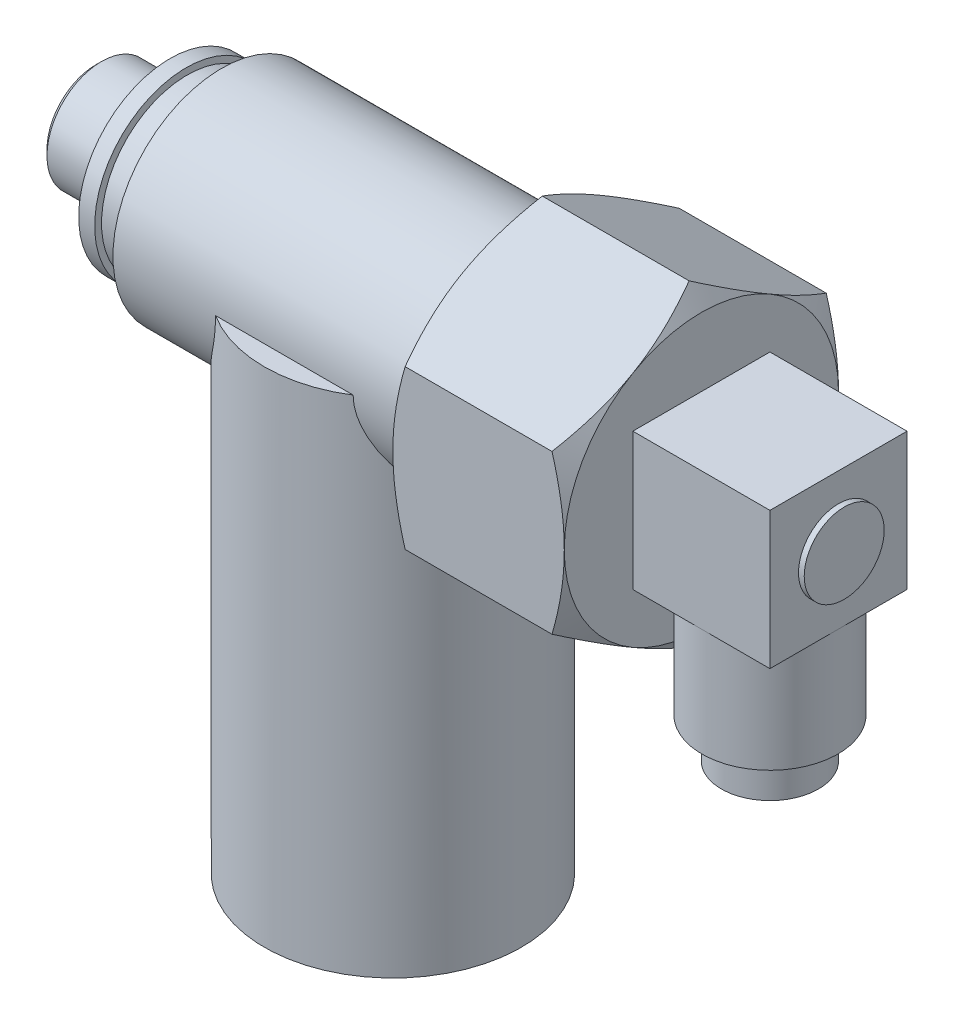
ISO-10303-21;
HEADER;
FILE_DESCRIPTION(('STEP AP214'),'2;1');
FILE_NAME('part.step','',(''),(''),'','','');
FILE_SCHEMA(('AUTOMOTIVE_DESIGN { 1 0 10303 214 1 1 1 1 }'));
ENDSEC;
DATA;
#1=APPLICATION_CONTEXT('core data for automotive mechanical design processes');
#2=APPLICATION_PROTOCOL_DEFINITION('international standard','automotive_design',2000,#1);
#3=PRODUCT_CONTEXT('',#1,'mechanical');
#4=PRODUCT('Part','Part','',(#3));
#5=PRODUCT_RELATED_PRODUCT_CATEGORY('part','',(#4));
#6=PRODUCT_DEFINITION_FORMATION('','',#4);
#7=PRODUCT_DEFINITION_CONTEXT('part definition',#1,'design');
#8=PRODUCT_DEFINITION('design','',#6,#7);
#9=PRODUCT_DEFINITION_SHAPE('','',#8);
#10=(LENGTH_UNIT() NAMED_UNIT(*) SI_UNIT(.MILLI.,.METRE.));
#11=(NAMED_UNIT(*) PLANE_ANGLE_UNIT() SI_UNIT($,.RADIAN.));
#12=(NAMED_UNIT(*) SI_UNIT($,.STERADIAN.) SOLID_ANGLE_UNIT());
#13=UNCERTAINTY_MEASURE_WITH_UNIT(LENGTH_MEASURE(1.E-05),#10,'distance_accuracy_value','');
#14=(GEOMETRIC_REPRESENTATION_CONTEXT(3) GLOBAL_UNCERTAINTY_ASSIGNED_CONTEXT((#13)) GLOBAL_UNIT_ASSIGNED_CONTEXT((#10,
#11,#12)) REPRESENTATION_CONTEXT('',''));
#15=CARTESIAN_POINT('',(0.,0.,0.));
#16=DIRECTION('',(0.,0.,1.));
#17=DIRECTION('',(1.,0.,0.));
#18=AXIS2_PLACEMENT_3D('',#15,#16,#17);
#19=CARTESIAN_POINT('',(65.,6.,6.));
#20=DIRECTION('',(-1.,0.,0.));
#21=DIRECTION('',(0.,0.,1.));
#22=AXIS2_PLACEMENT_3D('',#19,#20,#21);
#23=PLANE('',#22);
#24=DIRECTION('',(0.,1.,0.));
#25=VECTOR('',#24,1.);
#26=CARTESIAN_POINT('',(65.,6.,-6.));
#27=LINE('',#26,#25);
#28=CARTESIAN_POINT('',(65.,-6.,-6.));
#29=VERTEX_POINT('',#28);
#30=CARTESIAN_POINT('',(65.,6.,-6.));
#31=VERTEX_POINT('',#30);
#32=EDGE_CURVE('E219',#29,#31,#27,.T.);
#33=ORIENTED_EDGE('',*,*,#32,.T.);
#34=DIRECTION('',(0.,0.,-1.));
#35=VECTOR('',#34,1.);
#36=CARTESIAN_POINT('',(65.,6.,6.));
#37=LINE('',#36,#35);
#38=CARTESIAN_POINT('',(65.,6.,6.));
#39=VERTEX_POINT('',#38);
#40=EDGE_CURVE('E248',#39,#31,#37,.T.);
#41=ORIENTED_EDGE('',*,*,#40,.F.);
#42=DIRECTION('',(0.,1.,0.));
#43=VECTOR('',#42,1.);
#44=CARTESIAN_POINT('',(65.,6.,6.));
#45=LINE('',#44,#43);
#46=CARTESIAN_POINT('',(65.,-6.,6.));
#47=VERTEX_POINT('',#46);
#48=EDGE_CURVE('E229',#47,#39,#45,.T.);
#49=ORIENTED_EDGE('',*,*,#48,.F.);
#50=DIRECTION('',(0.,0.,-1.));
#51=VECTOR('',#50,1.);
#52=CARTESIAN_POINT('',(65.,-6.,6.));
#53=LINE('',#52,#51);
#54=EDGE_CURVE('E240',#47,#29,#53,.T.);
#55=ORIENTED_EDGE('',*,*,#54,.T.);
#56=EDGE_LOOP('',(#33,#41,#49,#55));
#57=FACE_BOUND('',#56,.T.);
#58=CARTESIAN_POINT('',(65.,0.,0.));
#59=DIRECTION('',(-1.,0.,0.));
#60=DIRECTION('',(0.,0.,1.));
#61=AXIS2_PLACEMENT_3D('',#58,#59,#60);
#62=CIRCLE('',#61,3.5);
#63=CARTESIAN_POINT('',(65.,0.,3.5));
#64=VERTEX_POINT('',#63);
#65=EDGE_CURVE('E11',#64,#64,#62,.F.);
#66=ORIENTED_EDGE('',*,*,#65,.F.);
#67=EDGE_LOOP('',(#66));
#68=FACE_BOUND('',#67,.T.);
#69=ADVANCED_FACE('F31',(#57,#68),#23,.F.);
#70=CARTESIAN_POINT('',(53.,6.92820323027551,-12.));
#71=DIRECTION('',(1.,0.,0.));
#72=DIRECTION('',(0.,0.,-1.));
#73=AXIS2_PLACEMENT_3D('',#70,#71,#72);
#74=PLANE('',#73);
#75=CARTESIAN_POINT('',(53.,0.,0.));
#76=DIRECTION('',(1.,0.,0.));
#77=DIRECTION('',(0.,0.,-1.));
#78=AXIS2_PLACEMENT_3D('',#75,#76,#77);
#79=CIRCLE('',#78,12.);
#80=CARTESIAN_POINT('',(53.,-10.3923048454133,-6.));
#81=VERTEX_POINT('',#80);
#82=CARTESIAN_POINT('',(53.,0.,-12.));
#83=VERTEX_POINT('',#82);
#84=EDGE_CURVE('E389',#81,#83,#79,.T.);
#85=ORIENTED_EDGE('',*,*,#84,.T.);
#86=CARTESIAN_POINT('',(53.,10.3923048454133,-6.));
#87=VERTEX_POINT('',#86);
#88=EDGE_CURVE('E393',#83,#87,#79,.T.);
#89=ORIENTED_EDGE('',*,*,#88,.T.);
#90=CARTESIAN_POINT('',(53.,10.3923048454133,6.));
#91=VERTEX_POINT('',#90);
#92=EDGE_CURVE('E1030',#87,#91,#79,.T.);
#93=ORIENTED_EDGE('',*,*,#92,.T.);
#94=CARTESIAN_POINT('',(53.,0.,0.));
#95=DIRECTION('',(-1.,0.,0.));
#96=DIRECTION('',(0.,0.,1.));
#97=AXIS2_PLACEMENT_3D('',#94,#95,#96);
#98=CIRCLE('',#97,12.);
#99=CARTESIAN_POINT('',(53.,0.,12.));
#100=VERTEX_POINT('',#99);
#101=EDGE_CURVE('E1017',#100,#91,#98,.T.);
#102=ORIENTED_EDGE('',*,*,#101,.F.);
#103=CARTESIAN_POINT('',(53.,-10.3923048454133,6.));
#104=VERTEX_POINT('',#103);
#105=EDGE_CURVE('E1028',#100,#104,#79,.T.);
#106=ORIENTED_EDGE('',*,*,#105,.T.);
#107=EDGE_CURVE('E392',#104,#81,#79,.T.);
#108=ORIENTED_EDGE('',*,*,#107,.T.);
#109=EDGE_LOOP('',(#85,#89,#93,#102,#106,#108));
#110=FACE_BOUND('',#109,.T.);
#111=DIRECTION('',(0.,0.,-1.));
#112=VECTOR('',#111,1.);
#113=CARTESIAN_POINT('',(53.,-6.,6.));
#114=LINE('',#113,#112);
#115=CARTESIAN_POINT('',(53.,-6.,6.));
#116=VERTEX_POINT('',#115);
#117=CARTESIAN_POINT('',(53.,-6.,-6.));
#118=VERTEX_POINT('',#117);
#119=EDGE_CURVE('E243',#116,#118,#114,.T.);
#120=ORIENTED_EDGE('',*,*,#119,.F.);
#121=DIRECTION('',(0.,-1.,0.));
#122=VECTOR('',#121,1.);
#123=CARTESIAN_POINT('',(53.,6.,6.));
#124=LINE('',#123,#122);
#125=CARTESIAN_POINT('',(53.,6.,6.));
#126=VERTEX_POINT('',#125);
#127=EDGE_CURVE('E235',#126,#116,#124,.T.);
#128=ORIENTED_EDGE('',*,*,#127,.F.);
#129=DIRECTION('',(0.,0.,-1.));
#130=VECTOR('',#129,1.);
#131=CARTESIAN_POINT('',(53.,6.,6.));
#132=LINE('',#131,#130);
#133=CARTESIAN_POINT('',(53.,6.,-6.));
#134=VERTEX_POINT('',#133);
#135=EDGE_CURVE('E246',#126,#134,#132,.T.);
#136=ORIENTED_EDGE('',*,*,#135,.T.);
#137=DIRECTION('',(0.,-1.,0.));
#138=VECTOR('',#137,1.);
#139=CARTESIAN_POINT('',(53.,6.,-6.));
#140=LINE('',#139,#138);
#141=EDGE_CURVE('E225',#134,#118,#140,.T.);
#142=ORIENTED_EDGE('',*,*,#141,.T.);
#143=EDGE_LOOP('',(#120,#128,#136,#142));
#144=FACE_BOUND('',#143,.T.);
#145=ADVANCED_FACE('F480',(#110,#144),#74,.T.);
#146=CARTESIAN_POINT('',(38.,6.92820323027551,-12.));
#147=DIRECTION('',(1.,0.,0.));
#148=DIRECTION('',(0.,0.,-1.));
#149=AXIS2_PLACEMENT_3D('',#146,#147,#148);
#150=PLANE('',#149);
#151=CARTESIAN_POINT('',(38.,0.,0.));
#152=DIRECTION('',(1.,0.,0.));
#153=DIRECTION('',(0.,0.,-1.));
#154=AXIS2_PLACEMENT_3D('',#151,#152,#153);
#155=CIRCLE('',#154,9.5);
#156=CARTESIAN_POINT('',(38.,0.,-9.5));
#157=VERTEX_POINT('',#156);
#158=EDGE_CURVE('E362',#157,#157,#155,.T.);
#159=ORIENTED_EDGE('',*,*,#158,.T.);
#160=EDGE_LOOP('',(#159));
#161=FACE_BOUND('',#160,.T.);
#162=CARTESIAN_POINT('',(38.,0.,0.));
#163=DIRECTION('',(1.,0.,0.));
#164=DIRECTION('',(0.,0.,-1.));
#165=AXIS2_PLACEMENT_3D('',#162,#163,#164);
#166=CIRCLE('',#165,12.);
#167=CARTESIAN_POINT('',(38.,0.,-12.));
#168=VERTEX_POINT('',#167);
#169=CARTESIAN_POINT('',(38.,10.3923048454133,-6.));
#170=VERTEX_POINT('',#169);
#171=EDGE_CURVE('E167',#168,#170,#166,.T.);
#172=ORIENTED_EDGE('',*,*,#171,.F.);
#173=CARTESIAN_POINT('',(38.,-10.3923048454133,-6.));
#174=VERTEX_POINT('',#173);
#175=EDGE_CURVE('E394',#174,#168,#166,.T.);
#176=ORIENTED_EDGE('',*,*,#175,.F.);
#177=CARTESIAN_POINT('',(38.,-10.3923048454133,6.));
#178=VERTEX_POINT('',#177);
#179=EDGE_CURVE('E396',#178,#174,#166,.T.);
#180=ORIENTED_EDGE('',*,*,#179,.F.);
#181=CARTESIAN_POINT('',(38.,0.,12.));
#182=VERTEX_POINT('',#181);
#183=EDGE_CURVE('E1007',#182,#178,#166,.T.);
#184=ORIENTED_EDGE('',*,*,#183,.F.);
#185=CARTESIAN_POINT('',(38.,0.,0.));
#186=DIRECTION('',(-1.,0.,0.));
#187=DIRECTION('',(0.,0.,1.));
#188=AXIS2_PLACEMENT_3D('',#185,#186,#187);
#189=CIRCLE('',#188,12.);
#190=CARTESIAN_POINT('',(38.,10.3923048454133,6.));
#191=VERTEX_POINT('',#190);
#192=EDGE_CURVE('E251',#182,#191,#189,.T.);
#193=ORIENTED_EDGE('',*,*,#192,.T.);
#194=EDGE_CURVE('E488',#170,#191,#166,.T.);
#195=ORIENTED_EDGE('',*,*,#194,.F.);
#196=EDGE_LOOP('',(#172,#176,#180,#184,#193,#195));
#197=FACE_BOUND('',#196,.T.);
#198=ADVANCED_FACE('F477',(#161,#197),#150,.F.);
#199=CARTESIAN_POINT('',(0.,0.,0.));
#200=DIRECTION('',(-1.,0.,0.));
#201=DIRECTION('',(0.,0.,1.));
#202=AXIS2_PLACEMENT_3D('',#199,#200,#201);
#203=PLANE('',#202);
#204=CARTESIAN_POINT('',(0.,0.,0.));
#205=DIRECTION('',(-1.,0.,0.));
#206=DIRECTION('',(0.,0.,1.));
#207=AXIS2_PLACEMENT_3D('',#204,#205,#206);
#208=CIRCLE('',#207,4.27500000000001);
#209=CARTESIAN_POINT('',(0.,0.,4.27500000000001));
#210=VERTEX_POINT('',#209);
#211=EDGE_CURVE('E39',#210,#210,#208,.T.);
#212=ORIENTED_EDGE('',*,*,#211,.T.);
#213=EDGE_LOOP('',(#212));
#214=FACE_BOUND('',#213,.T.);
#215=ADVANCED_FACE('F33',(#214),#203,.T.);
#216=CARTESIAN_POINT('',(0.,0.,0.));
#217=DIRECTION('',(1.,0.,0.));
#218=DIRECTION('',(0.,0.,-1.));
#219=AXIS2_PLACEMENT_3D('',#216,#217,#218);
#220=CYLINDRICAL_SURFACE('',#219,4.775);
#221=CARTESIAN_POINT('',(0.499999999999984,0.,0.));
#222=DIRECTION('',(-1.,0.,0.));
#223=DIRECTION('',(0.,0.,1.));
#224=AXIS2_PLACEMENT_3D('',#221,#222,#223);
#225=CIRCLE('',#224,4.775);
#226=CARTESIAN_POINT('',(0.499999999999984,0.,4.775));
#227=VERTEX_POINT('',#226);
#228=EDGE_CURVE('E416',#227,#227,#225,.F.);
#229=ORIENTED_EDGE('',*,*,#228,.T.);
#230=EDGE_LOOP('',(#229));
#231=FACE_BOUND('',#230,.T.);
#232=CARTESIAN_POINT('',(6.5,0.,0.));
#233=DIRECTION('',(1.,0.,0.));
#234=DIRECTION('',(0.,0.,-1.));
#235=AXIS2_PLACEMENT_3D('',#232,#233,#234);
#236=CIRCLE('',#235,4.775);
#237=CARTESIAN_POINT('',(6.5,0.,-4.775));
#238=VERTEX_POINT('',#237);
#239=EDGE_CURVE('E386',#238,#238,#236,.T.);
#240=ORIENTED_EDGE('',*,*,#239,.F.);
#241=EDGE_LOOP('',(#240));
#242=FACE_BOUND('',#241,.T.);
#243=ADVANCED_FACE('F427',(#231,#242),#220,.T.);
#244=CARTESIAN_POINT('',(6.5,4.775,0.));
#245=DIRECTION('',(-1.,0.,0.));
#246=DIRECTION('',(0.,0.,1.));
#247=AXIS2_PLACEMENT_3D('',#244,#245,#246);
#248=PLANE('',#247);
#249=ORIENTED_EDGE('',*,*,#239,.T.);
#250=EDGE_LOOP('',(#249));
#251=FACE_BOUND('',#250,.T.);
#252=CARTESIAN_POINT('',(6.5,0.,0.));
#253=DIRECTION('',(1.,0.,0.));
#254=DIRECTION('',(0.,0.,-1.));
#255=AXIS2_PLACEMENT_3D('',#252,#253,#254);
#256=CIRCLE('',#255,8.);
#257=CARTESIAN_POINT('',(6.5,0.,-8.));
#258=VERTEX_POINT('',#257);
#259=EDGE_CURVE('E383',#258,#258,#256,.T.);
#260=ORIENTED_EDGE('',*,*,#259,.F.);
#261=EDGE_LOOP('',(#260));
#262=FACE_BOUND('',#261,.T.);
#263=ADVANCED_FACE('F430',(#251,#262),#248,.T.);
#264=CARTESIAN_POINT('',(0.,0.,0.));
#265=DIRECTION('',(1.,0.,0.));
#266=DIRECTION('',(0.,0.,-1.));
#267=AXIS2_PLACEMENT_3D('',#264,#265,#266);
#268=CYLINDRICAL_SURFACE('',#267,8.);
#269=ORIENTED_EDGE('',*,*,#259,.T.);
#270=EDGE_LOOP('',(#269));
#271=FACE_BOUND('',#270,.T.);
#272=CARTESIAN_POINT('',(7.9,0.,0.));
#273=DIRECTION('',(1.,0.,0.));
#274=DIRECTION('',(0.,0.,-1.));
#275=AXIS2_PLACEMENT_3D('',#272,#273,#274);
#276=CIRCLE('',#275,8.);
#277=CARTESIAN_POINT('',(7.9,0.,-8.));
#278=VERTEX_POINT('',#277);
#279=EDGE_CURVE('E380',#278,#278,#276,.T.);
#280=ORIENTED_EDGE('',*,*,#279,.F.);
#281=EDGE_LOOP('',(#280));
#282=FACE_BOUND('',#281,.T.);
#283=ADVANCED_FACE('F435',(#271,#282),#268,.T.);
#284=CARTESIAN_POINT('',(7.9,4.775,0.));
#285=DIRECTION('',(1.,0.,0.));
#286=DIRECTION('',(0.,0.,-1.));
#287=AXIS2_PLACEMENT_3D('',#284,#285,#286);
#288=PLANE('',#287);
#289=ORIENTED_EDGE('',*,*,#279,.T.);
#290=EDGE_LOOP('',(#289));
#291=FACE_BOUND('',#290,.T.);
#292=CARTESIAN_POINT('',(7.9,0.,0.));
#293=DIRECTION('',(1.,0.,0.));
#294=DIRECTION('',(0.,0.,-1.));
#295=AXIS2_PLACEMENT_3D('',#292,#293,#294);
#296=CIRCLE('',#295,4.775);
#297=CARTESIAN_POINT('',(7.9,0.,-4.775));
#298=VERTEX_POINT('',#297);
#299=EDGE_CURVE('E377',#298,#298,#296,.T.);
#300=ORIENTED_EDGE('',*,*,#299,.F.);
#301=EDGE_LOOP('',(#300));
#302=FACE_BOUND('',#301,.T.);
#303=ADVANCED_FACE('F441',(#291,#302),#288,.T.);
#304=CARTESIAN_POINT('',(0.,0.,0.));
#305=DIRECTION('',(1.,0.,0.));
#306=DIRECTION('',(0.,0.,-1.));
#307=AXIS2_PLACEMENT_3D('',#304,#305,#306);
#308=CYLINDRICAL_SURFACE('',#307,4.775);
#309=ORIENTED_EDGE('',*,*,#299,.T.);
#310=EDGE_LOOP('',(#309));
#311=FACE_BOUND('',#310,.T.);
#312=CARTESIAN_POINT('',(8.,0.,0.));
#313=DIRECTION('',(1.,0.,0.));
#314=DIRECTION('',(0.,0.,-1.));
#315=AXIS2_PLACEMENT_3D('',#312,#313,#314);
#316=CIRCLE('',#315,4.775);
#317=CARTESIAN_POINT('',(8.,0.,-4.775));
#318=VERTEX_POINT('',#317);
#319=EDGE_CURVE('E374',#318,#318,#316,.T.);
#320=ORIENTED_EDGE('',*,*,#319,.F.);
#321=EDGE_LOOP('',(#320));
#322=FACE_BOUND('',#321,.T.);
#323=ADVANCED_FACE('F447',(#311,#322),#308,.T.);
#324=CARTESIAN_POINT('',(8.,4.775,0.));
#325=DIRECTION('',(-1.,0.,0.));
#326=DIRECTION('',(0.,0.,1.));
#327=AXIS2_PLACEMENT_3D('',#324,#325,#326);
#328=PLANE('',#327);
#329=ORIENTED_EDGE('',*,*,#319,.T.);
#330=EDGE_LOOP('',(#329));
#331=FACE_BOUND('',#330,.T.);
#332=CARTESIAN_POINT('',(8.,0.,0.));
#333=DIRECTION('',(1.,0.,0.));
#334=DIRECTION('',(0.,0.,-1.));
#335=AXIS2_PLACEMENT_3D('',#332,#333,#334);
#336=CIRCLE('',#335,7.5);
#337=CARTESIAN_POINT('',(8.,0.,-7.5));
#338=VERTEX_POINT('',#337);
#339=EDGE_CURVE('E371',#338,#338,#336,.T.);
#340=ORIENTED_EDGE('',*,*,#339,.F.);
#341=EDGE_LOOP('',(#340));
#342=FACE_BOUND('',#341,.T.);
#343=ADVANCED_FACE('F453',(#331,#342),#328,.T.);
#344=CARTESIAN_POINT('',(0.,0.,0.));
#345=DIRECTION('',(1.,0.,0.));
#346=DIRECTION('',(0.,0.,-1.));
#347=AXIS2_PLACEMENT_3D('',#344,#345,#346);
#348=CYLINDRICAL_SURFACE('',#347,7.5);
#349=ORIENTED_EDGE('',*,*,#339,.T.);
#350=EDGE_LOOP('',(#349));
#351=FACE_BOUND('',#350,.T.);
#352=CARTESIAN_POINT('',(11.,0.,0.));
#353=DIRECTION('',(1.,0.,0.));
#354=DIRECTION('',(0.,0.,-1.));
#355=AXIS2_PLACEMENT_3D('',#352,#353,#354);
#356=CIRCLE('',#355,7.5);
#357=CARTESIAN_POINT('',(11.,0.,-7.5));
#358=VERTEX_POINT('',#357);
#359=EDGE_CURVE('E368',#358,#358,#356,.T.);
#360=ORIENTED_EDGE('',*,*,#359,.F.);
#361=EDGE_LOOP('',(#360));
#362=FACE_BOUND('',#361,.T.);
#363=ADVANCED_FACE('F459',(#351,#362),#348,.T.);
#364=CARTESIAN_POINT('',(11.,7.5,0.));
#365=DIRECTION('',(-1.,0.,0.));
#366=DIRECTION('',(0.,0.,1.));
#367=AXIS2_PLACEMENT_3D('',#364,#365,#366);
#368=PLANE('',#367);
#369=ORIENTED_EDGE('',*,*,#359,.T.);
#370=EDGE_LOOP('',(#369));
#371=FACE_BOUND('',#370,.T.);
#372=CARTESIAN_POINT('',(11.,0.,0.));
#373=DIRECTION('',(1.,0.,0.));
#374=DIRECTION('',(0.,0.,-1.));
#375=AXIS2_PLACEMENT_3D('',#372,#373,#374);
#376=CIRCLE('',#375,9.5);
#377=CARTESIAN_POINT('',(11.,0.,-9.5));
#378=VERTEX_POINT('',#377);
#379=EDGE_CURVE('E365',#378,#378,#376,.T.);
#380=ORIENTED_EDGE('',*,*,#379,.F.);
#381=EDGE_LOOP('',(#380));
#382=FACE_BOUND('',#381,.T.);
#383=ADVANCED_FACE('F465',(#371,#382),#368,.T.);
#384=CARTESIAN_POINT('',(0.,0.,0.));
#385=DIRECTION('',(1.,0.,0.));
#386=DIRECTION('',(0.,0.,-1.));
#387=AXIS2_PLACEMENT_3D('',#384,#385,#386);
#388=CYLINDRICAL_SURFACE('',#387,9.5);
#389=CARTESIAN_POINT('',(19.974014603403,0.,-9.5));
#390=CARTESIAN_POINT('',(19.9740165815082,0.164189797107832,-9.50000073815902));
#391=CARTESIAN_POINT('',(19.967272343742,0.328370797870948,-9.49573318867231));
#392=CARTESIAN_POINT('',(19.9406874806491,0.655212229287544,-9.47879090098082));
#393=CARTESIAN_POINT('',(19.9208471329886,0.817872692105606,-9.46611634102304));
#394=CARTESIAN_POINT('',(19.8690527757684,1.1408372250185,-9.4326522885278));
#395=CARTESIAN_POINT('',(19.8370656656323,1.30113360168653,-9.41184061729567));
#396=CARTESIAN_POINT('',(19.7624640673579,1.61805512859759,-9.36256582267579));
#397=CARTESIAN_POINT('',(19.7198453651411,1.77467879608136,-9.334099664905));
#398=CARTESIAN_POINT('',(19.6066988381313,2.14577866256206,-9.25713569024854));
#399=CARTESIAN_POINT('',(19.5318373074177,2.35821762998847,-9.20518467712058));
#400=CARTESIAN_POINT('',(19.3688319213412,2.77427364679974,-9.08846267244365));
#401=CARTESIAN_POINT('',(19.280681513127,2.97788627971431,-9.02368535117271));
#402=CARTESIAN_POINT('',(19.0945837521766,3.37690693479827,-8.88208476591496));
#403=CARTESIAN_POINT('',(18.9966114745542,3.5722922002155,-8.80523055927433));
#404=CARTESIAN_POINT('',(18.7940735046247,3.9546350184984,-8.64026647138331));
#405=CARTESIAN_POINT('',(18.6895081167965,4.14159295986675,-8.55215710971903));
#406=CARTESIAN_POINT('',(18.4250746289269,4.59515752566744,-8.32027362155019));
#407=CARTESIAN_POINT('',(18.2627043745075,4.85702834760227,-8.1700495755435));
#408=CARTESIAN_POINT('',(17.9347473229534,5.36405441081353,-7.846487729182));
#409=CARTESIAN_POINT('',(17.7691590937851,5.60920198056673,-7.6731394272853));
#410=CARTESIAN_POINT('',(17.4396238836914,6.0824603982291,-7.30367702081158));
#411=CARTESIAN_POINT('',(17.275675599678,6.31058588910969,-7.10758286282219));
#412=CARTESIAN_POINT('',(16.9533557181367,6.74917398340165,-6.69251395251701));
#413=CARTESIAN_POINT('',(16.794981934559,6.9596435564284,-6.47354830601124));
#414=CARTESIAN_POINT('',(16.5209229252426,7.31782893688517,-6.06272659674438));
#415=CARTESIAN_POINT('',(16.4034315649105,7.46925192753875,-5.87529763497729));
#416=CARTESIAN_POINT('',(16.175979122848,7.7593162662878,-5.48651167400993));
#417=CARTESIAN_POINT('',(16.0660164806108,7.89796026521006,-5.28515757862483));
#418=CARTESIAN_POINT('',(15.8555925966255,8.16104910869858,-4.8690641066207));
#419=CARTESIAN_POINT('',(15.7551194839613,8.28551173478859,-4.65434202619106));
#420=CARTESIAN_POINT('',(15.5654232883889,8.51895050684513,-4.21188878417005));
#421=CARTESIAN_POINT('',(15.4761981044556,8.62792954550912,-3.98416006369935));
#422=CARTESIAN_POINT('',(15.3255018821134,8.81105056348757,-3.55798726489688));
#423=CARTESIAN_POINT('',(15.2619120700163,8.88794608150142,-3.36147236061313));
#424=CARTESIAN_POINT('',(15.1446915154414,9.0292179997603,-2.96112451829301));
#425=CARTESIAN_POINT('',(15.0910587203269,9.09359698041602,-2.75729309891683));
#426=CARTESIAN_POINT('',(14.9947254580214,9.20893986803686,-2.34340733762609));
#427=CARTESIAN_POINT('',(14.9520212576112,9.25990835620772,-2.13335514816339));
#428=CARTESIAN_POINT('',(14.8783611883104,9.34766919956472,-1.70826658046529));
#429=CARTESIAN_POINT('',(14.8474054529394,9.38446139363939,-1.49323014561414));
#430=CARTESIAN_POINT('',(14.7977864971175,9.44337552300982,-1.05874124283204));
#431=CARTESIAN_POINT('',(14.7791793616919,9.46543052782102,-0.839273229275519));
#432=CARTESIAN_POINT('',(14.7548990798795,9.49420110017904,-0.398615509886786));
#433=CARTESIAN_POINT('',(14.7492259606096,9.50091663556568,-0.177425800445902));
#434=CARTESIAN_POINT('',(14.7509437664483,9.49888237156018,0.264819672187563));
#435=CARTESIAN_POINT('',(14.7583340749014,9.49013330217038,0.485875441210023));
#436=CARTESIAN_POINT('',(14.7860087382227,9.45733459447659,0.926024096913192));
#437=CARTESIAN_POINT('',(14.8062925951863,9.43328554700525,1.14511705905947));
#438=CARTESIAN_POINT('',(14.8573880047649,9.37259561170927,1.56395685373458));
#439=CARTESIAN_POINT('',(14.8873362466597,9.33698620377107,1.76396067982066));
#440=CARTESIAN_POINT('',(14.9574071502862,9.25347896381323,2.15963522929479));
#441=CARTESIAN_POINT('',(14.9975332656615,9.20557696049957,2.35530445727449));
#442=CARTESIAN_POINT('',(15.0872557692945,9.09815139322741,2.74111863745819));
#443=CARTESIAN_POINT('',(15.1368491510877,9.03863151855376,2.9312653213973));
#444=CARTESIAN_POINT('',(15.2447515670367,8.90865762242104,3.30530525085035));
#445=CARTESIAN_POINT('',(15.303063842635,8.8381995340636,3.48919613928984));
#446=CARTESIAN_POINT('',(15.4326041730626,8.68098502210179,3.86460709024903));
#447=CARTESIAN_POINT('',(15.5044957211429,8.59337084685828,4.05553923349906));
#448=CARTESIAN_POINT('',(15.6563956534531,8.40717174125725,4.42865499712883));
#449=CARTESIAN_POINT('',(15.7364072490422,8.30858246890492,4.61083511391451));
#450=CARTESIAN_POINT('',(15.9870671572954,7.99759340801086,5.14369338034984));
#451=CARTESIAN_POINT('',(16.1683463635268,7.76996544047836,5.48070573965));
#452=CARTESIAN_POINT('',(16.5016702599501,7.3429364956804,6.03495796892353));
#453=CARTESIAN_POINT('',(16.6493997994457,7.15111450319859,6.26084019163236));
#454=CARTESIAN_POINT('',(16.9524465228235,6.75003864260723,6.69130021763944));
#455=CARTESIAN_POINT('',(17.1077671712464,6.54077678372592,6.89586815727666));
#456=CARTESIAN_POINT('',(17.4227234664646,6.10571512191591,7.28391473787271));
#457=CARTESIAN_POINT('',(17.5823665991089,5.87988529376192,7.46735346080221));
#458=CARTESIAN_POINT('',(17.9018830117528,5.41259055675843,7.81269854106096));
#459=CARTESIAN_POINT('',(18.0617561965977,5.17113091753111,7.97461209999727));
#460=CARTESIAN_POINT('',(18.3389140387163,4.73297572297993,8.24000183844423));
#461=CARTESIAN_POINT('',(18.4571105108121,4.53965392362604,8.34811928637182));
#462=CARTESIAN_POINT('',(18.6886552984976,4.14356399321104,8.55163593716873));
#463=CARTESIAN_POINT('',(18.8020031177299,3.94079489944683,8.64703384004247));
#464=CARTESIAN_POINT('',(19.0205299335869,3.52583548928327,8.82435508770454));
#465=CARTESIAN_POINT('',(19.1257278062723,3.31366884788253,8.90631009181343));
#466=CARTESIAN_POINT('',(19.3243014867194,2.87920657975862,9.05610327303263));
#467=CARTESIAN_POINT('',(19.4176838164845,2.65691663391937,9.12394925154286));
#468=CARTESIAN_POINT('',(19.611891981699,2.13738410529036,9.26134318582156));
#469=CARTESIAN_POINT('',(19.7073839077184,1.83668989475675,9.3259701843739));
#470=CARTESIAN_POINT('',(19.8208874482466,1.37519909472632,9.4012303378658));
#471=CARTESIAN_POINT('',(19.853754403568,1.21973265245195,9.42269667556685));
#472=CARTESIAN_POINT('',(19.9082385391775,0.906018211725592,9.4580126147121));
#473=CARTESIAN_POINT('',(19.9298615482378,0.747771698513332,9.47186616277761));
#474=CARTESIAN_POINT('',(19.9609387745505,0.428118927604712,9.49171164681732));
#475=CARTESIAN_POINT('',(19.9702801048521,0.266697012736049,9.49763066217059));
#476=CARTESIAN_POINT('',(19.9759156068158,-0.0564643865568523,9.50120620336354));
#477=CARTESIAN_POINT('',(19.9722102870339,-0.218203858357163,9.49886305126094));
#478=CARTESIAN_POINT('',(19.9519489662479,-0.540696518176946,9.4859748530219));
#479=CARTESIAN_POINT('',(19.9353801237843,-0.701448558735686,9.47542161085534));
#480=CARTESIAN_POINT('',(19.8902534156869,-1.02052667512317,9.44638594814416));
#481=CARTESIAN_POINT('',(19.8616935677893,-1.17885234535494,9.42790221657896));
#482=CARTESIAN_POINT('',(19.7865067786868,-1.52634086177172,9.37856269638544));
#483=CARTESIAN_POINT('',(19.737295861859,-1.71468399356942,9.34588620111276));
#484=CARTESIAN_POINT('',(19.6258215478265,-2.08542149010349,9.2702143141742));
#485=CARTESIAN_POINT('',(19.563547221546,-2.26781072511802,9.22721027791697));
#486=CARTESIAN_POINT('',(19.4285493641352,-2.6266301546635,9.13156007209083));
#487=CARTESIAN_POINT('',(19.3557976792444,-2.80304265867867,9.07888781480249));
#488=CARTESIAN_POINT('',(19.2024449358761,-3.14933851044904,8.96464727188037));
#489=CARTESIAN_POINT('',(19.1218458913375,-3.31922351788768,8.90308126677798));
#490=CARTESIAN_POINT('',(18.9030716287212,-3.75616083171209,8.73073110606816));
#491=CARTESIAN_POINT('',(18.7601772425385,-4.01816435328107,8.61309497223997));
#492=CARTESIAN_POINT('',(18.4659562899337,-4.5268418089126,8.35696306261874));
#493=CARTESIAN_POINT('',(18.3146249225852,-4.77350684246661,8.21845533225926));
#494=CARTESIAN_POINT('',(18.0083763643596,-5.25237409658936,7.92099049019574));
#495=CARTESIAN_POINT('',(17.8534548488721,-5.48455748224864,7.76200753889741));
#496=CARTESIAN_POINT('',(17.5442339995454,-5.93414365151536,7.42394861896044));
#497=CARTESIAN_POINT('',(17.389934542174,-6.15154952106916,7.24487686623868));
#498=CARTESIAN_POINT('',(17.0798223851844,-6.57870766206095,6.85975553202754));
#499=CARTESIAN_POINT('',(16.9241558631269,-6.787900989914,6.65296582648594));
#500=CARTESIAN_POINT('',(16.6205734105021,-7.18875875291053,6.21765896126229));
#501=CARTESIAN_POINT('',(16.4726589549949,-7.38041985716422,5.98913768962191));
#502=CARTESIAN_POINT('',(16.1884557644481,-7.74381513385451,5.51118911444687));
#503=CARTESIAN_POINT('',(16.0521368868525,-7.91560141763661,5.26181957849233));
#504=CARTESIAN_POINT('',(15.7942559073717,-8.23735135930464,4.74228541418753));
#505=CARTESIAN_POINT('',(15.6726856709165,-8.38732705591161,4.47213238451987));
#506=CARTESIAN_POINT('',(15.484128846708,-8.61823236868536,4.00259610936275));
#507=CARTESIAN_POINT('',(15.4121763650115,-8.70583875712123,3.80845795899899));
#508=CARTESIAN_POINT('',(15.2778206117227,-8.8687516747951,3.41191399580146));
#509=CARTESIAN_POINT('',(15.2154147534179,-8.94406153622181,3.20951044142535));
#510=CARTESIAN_POINT('',(15.1012556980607,-9.08138659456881,2.79742053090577));
#511=CARTESIAN_POINT('',(15.0494973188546,-9.14340825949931,2.58773777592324));
#512=CARTESIAN_POINT('',(14.9575875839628,-9.25328477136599,2.1621764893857));
#513=CARTESIAN_POINT('',(14.917436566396,-9.30113920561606,1.94629777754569));
#514=CARTESIAN_POINT('',(14.8493887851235,-9.38211680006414,1.50854615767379));
#515=CARTESIAN_POINT('',(14.8215646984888,-9.41515260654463,1.28664567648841));
#516=CARTESIAN_POINT('',(14.7791448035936,-9.46547807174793,0.839803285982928));
#517=CARTESIAN_POINT('',(14.7645489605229,-9.4827677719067,0.614861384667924));
#518=CARTESIAN_POINT('',(14.748931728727,-9.50126632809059,0.163887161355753));
#519=CARTESIAN_POINT('',(14.7479077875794,-9.50247820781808,-0.0621449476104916));
#520=CARTESIAN_POINT('',(14.7594536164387,-9.48880376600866,-0.513362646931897));
#521=CARTESIAN_POINT('',(14.7720225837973,-9.47391839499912,-0.738548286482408));
#522=CARTESIAN_POINT('',(14.8087533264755,-9.43035653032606,-1.16638744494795));
#523=CARTESIAN_POINT('',(14.8317942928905,-9.40301285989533,-1.36927584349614));
#524=CARTESIAN_POINT('',(14.8884928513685,-9.33559981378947,-1.77148760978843));
#525=CARTESIAN_POINT('',(14.9221540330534,-9.29552613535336,-1.97080974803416));
#526=CARTESIAN_POINT('',(14.9994771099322,-9.20324061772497,-2.36458280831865));
#527=CARTESIAN_POINT('',(15.0431368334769,-9.1510314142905,-2.55903477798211));
#528=CARTESIAN_POINT('',(15.1397465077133,-9.03513308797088,-2.94218515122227));
#529=CARTESIAN_POINT('',(15.192699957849,-8.97143964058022,-3.13088135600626));
#530=CARTESIAN_POINT('',(15.3101733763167,-8.82958447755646,-3.51168244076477));
#531=CARTESIAN_POINT('',(15.3751638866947,-8.75082673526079,-3.70342009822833));
#532=CARTESIAN_POINT('',(15.5135581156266,-8.58226469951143,-4.07886371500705));
#533=CARTESIAN_POINT('',(15.5869651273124,-8.49245608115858,-4.26256649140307));
#534=CARTESIAN_POINT('',(15.8182566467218,-8.20778465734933,-4.80070760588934));
#535=CARTESIAN_POINT('',(15.9872973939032,-7.99757371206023,-5.14244937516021));
#536=CARTESIAN_POINT('',(16.3001924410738,-7.60160520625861,-5.7054047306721));
#537=CARTESIAN_POINT('',(16.4392524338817,-7.42358583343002,-5.93493048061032));
#538=CARTESIAN_POINT('',(16.7261030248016,-7.05031602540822,-6.37385357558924));
#539=CARTESIAN_POINT('',(16.8738972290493,-6.85505845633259,-6.58324251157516));
#540=CARTESIAN_POINT('',(17.1756520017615,-6.44789923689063,-6.98257182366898));
#541=CARTESIAN_POINT('',(17.3296366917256,-6.23592859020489,-7.17242322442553));
#542=CARTESIAN_POINT('',(17.6398188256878,-5.79692000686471,-7.53167670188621));
#543=CARTESIAN_POINT('',(17.796015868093,-5.56988477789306,-7.70108243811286));
#544=CARTESIAN_POINT('',(18.109910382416,-5.09638090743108,-8.02249245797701));
#545=CARTESIAN_POINT('',(18.267578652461,-4.84962182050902,-8.1740979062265));
#546=CARTESIAN_POINT('',(18.5765975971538,-4.3399915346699,-8.45572489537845));
#547=CARTESIAN_POINT('',(18.7279443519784,-4.0771105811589,-8.5857331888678));
#548=CARTESIAN_POINT('',(19.0169830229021,-3.53584521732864,-8.82239438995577));
#549=CARTESIAN_POINT('',(19.1547432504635,-3.25755065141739,-8.92916777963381));
#550=CARTESIAN_POINT('',(19.4085734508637,-2.68336331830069,-9.11814620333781));
#551=CARTESIAN_POINT('',(19.524677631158,-2.38749929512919,-9.20039010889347));
#552=CARTESIAN_POINT('',(19.6783305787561,-1.91717293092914,-9.30609342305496));
#553=CARTESIAN_POINT('',(19.7275911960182,-1.7486934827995,-9.33927655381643));
#554=CARTESIAN_POINT('',(19.8141000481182,-1.40716726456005,-9.39679942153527));
#555=CARTESIAN_POINT('',(19.8513507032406,-1.23412142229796,-9.42114094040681));
#556=CARTESIAN_POINT('',(19.911762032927,-0.885173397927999,-9.46029412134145));
#557=CARTESIAN_POINT('',(19.9349757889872,-0.709284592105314,-9.47514169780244));
#558=CARTESIAN_POINT('',(19.9661000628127,-0.355593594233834,-9.49499363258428));
#559=CARTESIAN_POINT('',(19.9740124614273,-0.177791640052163,-9.49999920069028));
#560=CARTESIAN_POINT('',(19.974014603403,0.,-9.5));
#561=B_SPLINE_CURVE_WITH_KNOTS('',3,(#389,#390,#391,#392,#393,#394,#395,#396,#397,#398,#399,
#400,#401,#402,#403,#404,#405,#406,#407,#408,#409,#410,#411,#412,#413,#414,#415,#416,#417,#418,
#419,#420,#421,#422,#423,#424,#425,#426,#427,#428,#429,#430,#431,#432,#433,#434,#435,#436,#437,
#438,#439,#440,#441,#442,#443,#444,#445,#446,#447,#448,#449,#450,#451,#452,#453,#454,#455,#456,
#457,#458,#459,#460,#461,#462,#463,#464,#465,#466,#467,#468,#469,#470,#471,#472,#473,#474,#475,
#476,#477,#478,#479,#480,#481,#482,#483,#484,#485,#486,#487,#488,#489,#490,#491,#492,#493,#494,
#495,#496,#497,#498,#499,#500,#501,#502,#503,#504,#505,#506,#507,#508,#509,#510,#511,#512,#513,
#514,#515,#516,#517,#518,#519,#520,#521,#522,#523,#524,#525,#526,#527,#528,#529,#530,#531,#532,
#533,#534,#535,#536,#537,#538,#539,#540,#541,#542,#543,#544,#545,#546,#547,#548,#549,#550,#551,
#552,#553,#554,#555,#556,#557,#558,#559,#560),.UNSPECIFIED.,.T.,.F.,(4,2,2,2,2,2,2,2,2,2,2,2,2,
2,2,2,2,2,2,2,2,2,2,2,2,2,2,2,2,2,2,2,2,2,2,2,2,2,2,2,2,2,2,2,2,2,2,2,2,2,2,2,2,2,2,2,2,2,2,2,2,
2,2,2,2,2,2,2,2,2,2,2,2,2,2,2,2,2,2,2,2,2,2,2,2,4),(0.,0.492365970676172,0.984721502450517,
1.47842847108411,1.97233144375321,2.66465954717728,3.35733016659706,4.05180534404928,
4.74624847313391,5.77327193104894,6.80076339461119,7.82736053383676,8.85355050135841,
9.65707224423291,10.4604269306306,11.2627629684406,12.0649489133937,12.7254917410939,
13.3858982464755,14.0460788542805,14.7062669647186,15.3694333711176,16.0326011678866,
16.6957376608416,17.3588485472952,17.9742073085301,18.589775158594,19.2051478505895,
19.8207498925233,20.4861983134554,21.1519109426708,22.4832808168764,23.475525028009,
24.4682264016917,25.4627734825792,26.4569869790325,27.2096959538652,27.9624818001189,
28.7134684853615,29.46403881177,30.426383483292,30.9069257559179,31.3872186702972,
31.8718960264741,32.3565544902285,32.841697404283,33.3269205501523,33.9181499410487,
34.5098759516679,35.1032227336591,35.696417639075,36.6573343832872,37.6188036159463,
38.581498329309,39.5439913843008,40.5412025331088,41.5386027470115,42.5333255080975,
43.5274971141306,44.2013296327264,44.874979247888,45.5483002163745,46.2216407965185,
46.8989000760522,47.5761575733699,48.2532876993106,48.930377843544,49.5477218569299,
50.1652747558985,50.7826936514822,51.400345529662,52.0513889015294,52.702687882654,
54.0043884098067,54.9694043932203,55.9348216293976,56.9044571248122,57.8739188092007,
58.8620864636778,59.8508580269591,60.8343733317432,61.8163216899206,62.3516868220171,
62.8869439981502,63.4201641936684,63.9533188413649),.UNSPECIFIED.);
#562=CARTESIAN_POINT('',(19.974014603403,0.,9.5));
#563=VERTEX_POINT('',#562);
#564=CARTESIAN_POINT('',(19.974014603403,0.,-9.5));
#565=VERTEX_POINT('',#564);
#566=EDGE_CURVE('E46',#563,#565,#561,.T.);
#567=ORIENTED_EDGE('',*,*,#566,.F.);
#568=DIRECTION('',(1.,0.,0.));
#569=VECTOR('',#568,1.);
#570=CARTESIAN_POINT('',(0.,0.,9.5));
#571=LINE('',#570,#569);
#572=CARTESIAN_POINT('',(32.025985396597,0.,9.5));
#573=VERTEX_POINT('',#572);
#574=EDGE_CURVE('E151',#573,#563,#571,.F.);
#575=ORIENTED_EDGE('',*,*,#574,.F.);
#576=CARTESIAN_POINT('',(32.025985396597,0.,-9.5));
#577=CARTESIAN_POINT('',(32.0259834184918,-0.164189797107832,-9.50000073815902));
#578=CARTESIAN_POINT('',(32.032727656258,-0.328370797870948,-9.49573318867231));
#579=CARTESIAN_POINT('',(32.0593125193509,-0.655212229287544,-9.47879090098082));
#580=CARTESIAN_POINT('',(32.0791528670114,-0.817872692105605,-9.46611634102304));
#581=CARTESIAN_POINT('',(32.1309472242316,-1.1408372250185,-9.4326522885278));
#582=CARTESIAN_POINT('',(32.1629343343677,-1.30113360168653,-9.41184061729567));
#583=CARTESIAN_POINT('',(32.2375359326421,-1.61805512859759,-9.36256582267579));
#584=CARTESIAN_POINT('',(32.2801546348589,-1.77467879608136,-9.334099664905));
#585=CARTESIAN_POINT('',(32.3933011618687,-2.14577866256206,-9.25713569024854));
#586=CARTESIAN_POINT('',(32.4681626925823,-2.35821762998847,-9.20518467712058));
#587=CARTESIAN_POINT('',(32.6311680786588,-2.77427364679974,-9.08846267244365));
#588=CARTESIAN_POINT('',(32.719318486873,-2.97788627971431,-9.02368535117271));
#589=CARTESIAN_POINT('',(32.9054162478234,-3.37690693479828,-8.88208476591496));
#590=CARTESIAN_POINT('',(33.0033885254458,-3.5722922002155,-8.80523055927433));
#591=CARTESIAN_POINT('',(33.2059264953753,-3.9546350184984,-8.64026647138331));
#592=CARTESIAN_POINT('',(33.3104918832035,-4.14159295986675,-8.55215710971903));
#593=CARTESIAN_POINT('',(33.5749253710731,-4.59515752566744,-8.32027362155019));
#594=CARTESIAN_POINT('',(33.7372956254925,-4.85702834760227,-8.1700495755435));
#595=CARTESIAN_POINT('',(34.0652526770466,-5.36405441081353,-7.846487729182));
#596=CARTESIAN_POINT('',(34.2308409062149,-5.60920198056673,-7.67313942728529));
#597=CARTESIAN_POINT('',(34.5603761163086,-6.08246039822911,-7.30367702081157));
#598=CARTESIAN_POINT('',(34.724324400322,-6.31058588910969,-7.10758286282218));
#599=CARTESIAN_POINT('',(35.0466442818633,-6.74917398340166,-6.692513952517));
#600=CARTESIAN_POINT('',(35.205018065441,-6.95964355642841,-6.47354830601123));
#601=CARTESIAN_POINT('',(35.4790770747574,-7.31782893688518,-6.06272659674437));
#602=CARTESIAN_POINT('',(35.5965684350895,-7.46925192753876,-5.87529763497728));
#603=CARTESIAN_POINT('',(35.824020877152,-7.75931626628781,-5.48651167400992));
#604=CARTESIAN_POINT('',(35.9339835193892,-7.89796026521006,-5.28515757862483));
#605=CARTESIAN_POINT('',(36.1444074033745,-8.16104910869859,-4.8690641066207));
#606=CARTESIAN_POINT('',(36.2448805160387,-8.28551173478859,-4.65434202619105));
#607=CARTESIAN_POINT('',(36.4345767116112,-8.51895050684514,-4.21188878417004));
#608=CARTESIAN_POINT('',(36.5238018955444,-8.62792954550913,-3.98416006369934));
#609=CARTESIAN_POINT('',(36.6744981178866,-8.81105056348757,-3.55798726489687));
#610=CARTESIAN_POINT('',(36.7380879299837,-8.88794608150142,-3.36147236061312));
#611=CARTESIAN_POINT('',(36.8553084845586,-9.0292179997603,-2.961124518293));
#612=CARTESIAN_POINT('',(36.9089412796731,-9.09359698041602,-2.75729309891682));
#613=CARTESIAN_POINT('',(37.0052745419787,-9.20893986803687,-2.34340733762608));
#614=CARTESIAN_POINT('',(37.0479787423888,-9.25990835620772,-2.13335514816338));
#615=CARTESIAN_POINT('',(37.1216388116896,-9.34766919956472,-1.70826658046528));
#616=CARTESIAN_POINT('',(37.1525945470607,-9.38446139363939,-1.49323014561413));
#617=CARTESIAN_POINT('',(37.2022135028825,-9.44337552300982,-1.05874124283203));
#618=CARTESIAN_POINT('',(37.2208206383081,-9.46543052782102,-0.83927322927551));
#619=CARTESIAN_POINT('',(37.2451009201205,-9.49420110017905,-0.398615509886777));
#620=CARTESIAN_POINT('',(37.2507740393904,-9.50091663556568,-0.177425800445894));
#621=CARTESIAN_POINT('',(37.2490562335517,-9.49888237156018,0.264819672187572));
#622=CARTESIAN_POINT('',(37.2416659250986,-9.49013330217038,0.485875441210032));
#623=CARTESIAN_POINT('',(37.2139912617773,-9.45733459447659,0.9260240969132));
#624=CARTESIAN_POINT('',(37.1937074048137,-9.43328554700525,1.14511705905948));
#625=CARTESIAN_POINT('',(37.1426119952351,-9.37259561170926,1.56395685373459));
#626=CARTESIAN_POINT('',(37.1126637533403,-9.33698620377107,1.76396067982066));
#627=CARTESIAN_POINT('',(37.0425928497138,-9.25347896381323,2.1596352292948));
#628=CARTESIAN_POINT('',(37.0024667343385,-9.20557696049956,2.3553044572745));
#629=CARTESIAN_POINT('',(36.9127442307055,-9.09815139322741,2.7411186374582));
#630=CARTESIAN_POINT('',(36.8631508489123,-9.03863151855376,2.93126532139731));
#631=CARTESIAN_POINT('',(36.7552484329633,-8.90865762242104,3.30530525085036));
#632=CARTESIAN_POINT('',(36.6969361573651,-8.8381995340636,3.48919613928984));
#633=CARTESIAN_POINT('',(36.5673958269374,-8.68098502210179,3.86460709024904));
#634=CARTESIAN_POINT('',(36.4955042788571,-8.59337084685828,4.05553923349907));
#635=CARTESIAN_POINT('',(36.3436043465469,-8.40717174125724,4.42865499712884));
#636=CARTESIAN_POINT('',(36.2635927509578,-8.30858246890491,4.61083511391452));
#637=CARTESIAN_POINT('',(36.0129328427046,-7.99759340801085,5.14369338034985));
#638=CARTESIAN_POINT('',(35.8316536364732,-7.76996544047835,5.48070573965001));
#639=CARTESIAN_POINT('',(35.4983297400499,-7.34293649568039,6.03495796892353));
#640=CARTESIAN_POINT('',(35.3506002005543,-7.15111450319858,6.26084019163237));
#641=CARTESIAN_POINT('',(35.0475534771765,-6.75003864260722,6.69130021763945));
#642=CARTESIAN_POINT('',(34.8922328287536,-6.54077678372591,6.89586815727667));
#643=CARTESIAN_POINT('',(34.5772765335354,-6.10571512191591,7.28391473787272));
#644=CARTESIAN_POINT('',(34.4176334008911,-5.87988529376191,7.46735346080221));
#645=CARTESIAN_POINT('',(34.0981169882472,-5.41259055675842,7.81269854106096));
#646=CARTESIAN_POINT('',(33.9382438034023,-5.17113091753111,7.97461209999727));
#647=CARTESIAN_POINT('',(33.6610859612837,-4.73297572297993,8.24000183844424));
#648=CARTESIAN_POINT('',(33.5428894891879,-4.53965392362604,8.34811928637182));
#649=CARTESIAN_POINT('',(33.3113447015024,-4.14356399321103,8.55163593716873));
#650=CARTESIAN_POINT('',(33.1979968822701,-3.94079489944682,8.64703384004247));
#651=CARTESIAN_POINT('',(32.9794700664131,-3.52583548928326,8.82435508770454));
#652=CARTESIAN_POINT('',(32.8742721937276,-3.31366884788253,8.90631009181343));
#653=CARTESIAN_POINT('',(32.6756985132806,-2.87920657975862,9.05610327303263));
#654=CARTESIAN_POINT('',(32.5823161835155,-2.65691663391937,9.12394925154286));
#655=CARTESIAN_POINT('',(32.388108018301,-2.13738410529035,9.26134318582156));
#656=CARTESIAN_POINT('',(32.2926160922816,-1.83668989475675,9.3259701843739));
#657=CARTESIAN_POINT('',(32.1791125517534,-1.37519909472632,9.4012303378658));
#658=CARTESIAN_POINT('',(32.146245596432,-1.21973265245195,9.42269667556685));
#659=CARTESIAN_POINT('',(32.0917614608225,-0.90601821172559,9.4580126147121));
#660=CARTESIAN_POINT('',(32.0701384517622,-0.747771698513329,9.47186616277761));
#661=CARTESIAN_POINT('',(32.0390612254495,-0.428118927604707,9.49171164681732));
#662=CARTESIAN_POINT('',(32.0297198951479,-0.266697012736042,9.49763066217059));
#663=CARTESIAN_POINT('',(32.0240843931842,0.0564643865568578,9.50120620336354));
#664=CARTESIAN_POINT('',(32.0277897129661,0.218203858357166,9.49886305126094));
#665=CARTESIAN_POINT('',(32.0480510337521,0.540696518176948,9.4859748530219));
#666=CARTESIAN_POINT('',(32.0646198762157,0.70144855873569,9.47542161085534));
#667=CARTESIAN_POINT('',(32.1097465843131,1.02052667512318,9.44638594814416));
#668=CARTESIAN_POINT('',(32.1383064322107,1.17885234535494,9.42790221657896));
#669=CARTESIAN_POINT('',(32.2134932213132,1.52634086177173,9.37856269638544));
#670=CARTESIAN_POINT('',(32.262704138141,1.71468399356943,9.34588620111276));
#671=CARTESIAN_POINT('',(32.3741784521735,2.0854214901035,9.2702143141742));
#672=CARTESIAN_POINT('',(32.436452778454,2.26781072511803,9.22721027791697));
#673=CARTESIAN_POINT('',(32.5714506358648,2.62663015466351,9.13156007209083));
#674=CARTESIAN_POINT('',(32.6442023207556,2.80304265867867,9.07888781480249));
#675=CARTESIAN_POINT('',(32.7975550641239,3.14933851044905,8.96464727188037));
#676=CARTESIAN_POINT('',(32.8781541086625,3.31922351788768,8.90308126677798));
#677=CARTESIAN_POINT('',(33.0969283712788,3.75616083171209,8.73073110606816));
#678=CARTESIAN_POINT('',(33.2398227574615,4.01816435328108,8.61309497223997));
#679=CARTESIAN_POINT('',(33.5340437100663,4.5268418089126,8.35696306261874));
#680=CARTESIAN_POINT('',(33.6853750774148,4.77350684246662,8.21845533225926));
#681=CARTESIAN_POINT('',(33.9916236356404,5.25237409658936,7.92099049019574));
#682=CARTESIAN_POINT('',(34.146545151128,5.48455748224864,7.7620075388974));
#683=CARTESIAN_POINT('',(34.4557660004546,5.93414365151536,7.42394861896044));
#684=CARTESIAN_POINT('',(34.610065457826,6.15154952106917,7.24487686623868));
#685=CARTESIAN_POINT('',(34.9201776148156,6.57870766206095,6.85975553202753));
#686=CARTESIAN_POINT('',(35.0758441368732,6.78790098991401,6.65296582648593));
#687=CARTESIAN_POINT('',(35.3794265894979,7.18875875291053,6.21765896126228));
#688=CARTESIAN_POINT('',(35.5273410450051,7.38041985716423,5.98913768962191));
#689=CARTESIAN_POINT('',(35.8115442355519,7.74381513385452,5.51118911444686));
#690=CARTESIAN_POINT('',(35.9478631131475,7.91560141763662,5.26181957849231));
#691=CARTESIAN_POINT('',(36.2057440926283,8.23735135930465,4.74228541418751));
#692=CARTESIAN_POINT('',(36.3273143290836,8.38732705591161,4.47213238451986));
#693=CARTESIAN_POINT('',(36.515871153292,8.61823236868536,4.00259610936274));
#694=CARTESIAN_POINT('',(36.5878236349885,8.70583875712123,3.80845795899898));
#695=CARTESIAN_POINT('',(36.7221793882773,8.8687516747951,3.41191399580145));
#696=CARTESIAN_POINT('',(36.7845852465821,8.94406153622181,3.20951044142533));
#697=CARTESIAN_POINT('',(36.8987443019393,9.08138659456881,2.79742053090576));
#698=CARTESIAN_POINT('',(36.9505026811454,9.14340825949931,2.58773777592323));
#699=CARTESIAN_POINT('',(37.0424124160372,9.25328477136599,2.16217648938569));
#700=CARTESIAN_POINT('',(37.082563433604,9.30113920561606,1.94629777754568));
#701=CARTESIAN_POINT('',(37.1506112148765,9.38211680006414,1.50854615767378));
#702=CARTESIAN_POINT('',(37.1784353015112,9.41515260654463,1.2866456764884));
#703=CARTESIAN_POINT('',(37.2208551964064,9.46547807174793,0.83980328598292));
#704=CARTESIAN_POINT('',(37.2354510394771,9.4827677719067,0.614861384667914));
#705=CARTESIAN_POINT('',(37.251068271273,9.50126632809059,0.16388716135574));
#706=CARTESIAN_POINT('',(37.2520922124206,9.50247820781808,-0.0621449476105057));
#707=CARTESIAN_POINT('',(37.2405463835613,9.48880376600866,-0.51336264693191));
#708=CARTESIAN_POINT('',(37.2279774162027,9.47391839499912,-0.738548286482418));
#709=CARTESIAN_POINT('',(37.1912466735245,9.43035653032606,-1.16638744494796));
#710=CARTESIAN_POINT('',(37.1682057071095,9.40301285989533,-1.36927584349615));
#711=CARTESIAN_POINT('',(37.1115071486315,9.33559981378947,-1.77148760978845));
#712=CARTESIAN_POINT('',(37.0778459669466,9.29552613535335,-1.97080974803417));
#713=CARTESIAN_POINT('',(37.0005228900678,9.20324061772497,-2.36458280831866));
#714=CARTESIAN_POINT('',(36.9568631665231,9.1510314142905,-2.55903477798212));
#715=CARTESIAN_POINT('',(36.8602534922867,9.03513308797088,-2.94218515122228));
#716=CARTESIAN_POINT('',(36.807300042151,8.97143964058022,-3.13088135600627));
#717=CARTESIAN_POINT('',(36.6898266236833,8.82958447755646,-3.51168244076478));
#718=CARTESIAN_POINT('',(36.6248361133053,8.75082673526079,-3.70342009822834));
#719=CARTESIAN_POINT('',(36.4864418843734,8.58226469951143,-4.07886371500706));
#720=CARTESIAN_POINT('',(36.4130348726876,8.49245608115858,-4.26256649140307));
#721=CARTESIAN_POINT('',(36.1817433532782,8.20778465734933,-4.80070760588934));
#722=CARTESIAN_POINT('',(36.0127026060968,7.99757371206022,-5.14244937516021));
#723=CARTESIAN_POINT('',(35.6998075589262,7.6016052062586,-5.70540473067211));
#724=CARTESIAN_POINT('',(35.5607475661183,7.42358583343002,-5.93493048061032));
#725=CARTESIAN_POINT('',(35.2738969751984,7.05031602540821,-6.37385357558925));
#726=CARTESIAN_POINT('',(35.1261027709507,6.85505845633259,-6.58324251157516));
#727=CARTESIAN_POINT('',(34.8243479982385,6.44789923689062,-6.98257182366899));
#728=CARTESIAN_POINT('',(34.6703633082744,6.23592859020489,-7.17242322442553));
#729=CARTESIAN_POINT('',(34.3601811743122,5.79692000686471,-7.53167670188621));
#730=CARTESIAN_POINT('',(34.203984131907,5.56988477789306,-7.70108243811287));
#731=CARTESIAN_POINT('',(33.890089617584,5.09638090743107,-8.02249245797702));
#732=CARTESIAN_POINT('',(33.732421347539,4.84962182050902,-8.17409790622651));
#733=CARTESIAN_POINT('',(33.4234024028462,4.3399915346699,-8.45572489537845));
#734=CARTESIAN_POINT('',(33.2720556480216,4.0771105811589,-8.5857331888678));
#735=CARTESIAN_POINT('',(32.9830169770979,3.53584521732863,-8.82239438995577));
#736=CARTESIAN_POINT('',(32.8452567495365,3.25755065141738,-8.92916777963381));
#737=CARTESIAN_POINT('',(32.5914265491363,2.68336331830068,-9.11814620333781));
#738=CARTESIAN_POINT('',(32.475322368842,2.38749929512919,-9.20039010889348));
#739=CARTESIAN_POINT('',(32.3216694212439,1.91717293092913,-9.30609342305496));
#740=CARTESIAN_POINT('',(32.2724088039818,1.74869348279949,-9.33927655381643));
#741=CARTESIAN_POINT('',(32.1858999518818,1.40716726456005,-9.39679942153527));
#742=CARTESIAN_POINT('',(32.1486492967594,1.23412142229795,-9.42114094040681));
#743=CARTESIAN_POINT('',(32.088237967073,0.885173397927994,-9.46029412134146));
#744=CARTESIAN_POINT('',(32.0650242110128,0.709284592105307,-9.47514169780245));
#745=CARTESIAN_POINT('',(32.0338999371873,0.355593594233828,-9.49499363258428));
#746=CARTESIAN_POINT('',(32.0259875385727,0.17779164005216,-9.49999920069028));
#747=CARTESIAN_POINT('',(32.025985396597,0.,-9.5));
#748=B_SPLINE_CURVE_WITH_KNOTS('',3,(#576,#577,#578,#579,#580,#581,#582,#583,#584,#585,#586,
#587,#588,#589,#590,#591,#592,#593,#594,#595,#596,#597,#598,#599,#600,#601,#602,#603,#604,#605,
#606,#607,#608,#609,#610,#611,#612,#613,#614,#615,#616,#617,#618,#619,#620,#621,#622,#623,#624,
#625,#626,#627,#628,#629,#630,#631,#632,#633,#634,#635,#636,#637,#638,#639,#640,#641,#642,#643,
#644,#645,#646,#647,#648,#649,#650,#651,#652,#653,#654,#655,#656,#657,#658,#659,#660,#661,#662,
#663,#664,#665,#666,#667,#668,#669,#670,#671,#672,#673,#674,#675,#676,#677,#678,#679,#680,#681,
#682,#683,#684,#685,#686,#687,#688,#689,#690,#691,#692,#693,#694,#695,#696,#697,#698,#699,#700,
#701,#702,#703,#704,#705,#706,#707,#708,#709,#710,#711,#712,#713,#714,#715,#716,#717,#718,#719,
#720,#721,#722,#723,#724,#725,#726,#727,#728,#729,#730,#731,#732,#733,#734,#735,#736,#737,#738,
#739,#740,#741,#742,#743,#744,#745,#746,#747),.UNSPECIFIED.,.T.,.F.,(4,2,2,2,2,2,2,2,2,2,2,2,2,
2,2,2,2,2,2,2,2,2,2,2,2,2,2,2,2,2,2,2,2,2,2,2,2,2,2,2,2,2,2,2,2,2,2,2,2,2,2,2,2,2,2,2,2,2,2,2,2,
2,2,2,2,2,2,2,2,2,2,2,2,2,2,2,2,2,2,2,2,2,2,2,2,4),(0.,0.492365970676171,0.984721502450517,
1.47842847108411,1.97233144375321,2.66465954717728,3.35733016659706,4.05180534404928,
4.74624847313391,5.77327193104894,6.8007633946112,7.82736053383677,8.85355050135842,
9.65707224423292,10.4604269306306,11.2627629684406,12.0649489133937,12.7254917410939,
13.3858982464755,14.0460788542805,14.7062669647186,15.3694333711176,16.0326011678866,
16.6957376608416,17.3588485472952,17.9742073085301,18.589775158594,19.2051478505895,
19.8207498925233,20.4861983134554,21.1519109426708,22.4832808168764,23.475525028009,
24.4682264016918,25.4627734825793,26.4569869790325,27.2096959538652,27.9624818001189,
28.7134684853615,29.4640388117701,30.426383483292,30.9069257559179,31.3872186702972,
31.8718960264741,32.3565544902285,32.841697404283,33.3269205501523,33.9181499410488,
34.5098759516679,35.1032227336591,35.696417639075,36.6573343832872,37.6188036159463,
38.581498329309,39.5439913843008,40.5412025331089,41.5386027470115,42.5333255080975,
43.5274971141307,44.2013296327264,44.874979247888,45.5483002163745,46.2216407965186,
46.8989000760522,47.57615757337,48.2532876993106,48.9303778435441,49.5477218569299,
50.1652747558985,50.7826936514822,51.400345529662,52.0513889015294,52.702687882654,
54.0043884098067,54.9694043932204,55.9348216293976,56.9044571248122,57.8739188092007,
58.8620864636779,59.8508580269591,60.8343733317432,61.8163216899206,62.3516868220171,
62.8869439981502,63.4201641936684,63.9533188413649),.UNSPECIFIED.);
#749=CARTESIAN_POINT('',(32.025985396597,0.,-9.5));
#750=VERTEX_POINT('',#749);
#751=EDGE_CURVE('E155',#750,#573,#748,.T.);
#752=ORIENTED_EDGE('',*,*,#751,.F.);
#753=DIRECTION('',(1.,0.,0.));
#754=VECTOR('',#753,1.);
#755=CARTESIAN_POINT('',(0.,0.,-9.5));
#756=LINE('',#755,#754);
#757=EDGE_CURVE('E51',#565,#750,#756,.T.);
#758=ORIENTED_EDGE('',*,*,#757,.F.);
#759=EDGE_LOOP('',(#567,#575,#752,#758));
#760=FACE_BOUND('',#759,.T.);
#761=ORIENTED_EDGE('',*,*,#379,.T.);
#762=EDGE_LOOP('',(#761));
#763=FACE_BOUND('',#762,.T.);
#764=ORIENTED_EDGE('',*,*,#158,.F.);
#765=EDGE_LOOP('',(#764));
#766=FACE_BOUND('',#765,.T.);
#767=ADVANCED_FACE('F153',(#760,#763,#766),#388,.T.);
#768=CARTESIAN_POINT('',(38.,0.,0.));
#769=DIRECTION('',(1.,0.,0.));
#770=DIRECTION('',(0.,0.,-1.));
#771=AXIS2_PLACEMENT_3D('',#768,#769,#770);
#772=CONICAL_SURFACE('',#771,12.,1.04719755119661);
#773=CARTESIAN_POINT('',(43.7423204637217,-18.3746159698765,-12.));
#774=CARTESIAN_POINT('',(43.6149851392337,-18.1111918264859,-12.));
#775=CARTESIAN_POINT('',(43.4883088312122,-17.8474492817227,-12.));
#776=CARTESIAN_POINT('',(43.2364255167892,-17.3192601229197,-12.));
#777=CARTESIAN_POINT('',(43.1112185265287,-17.0548135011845,-12.));
#778=CARTESIAN_POINT('',(42.7379921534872,-16.2602391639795,-12.));
#779=CARTESIAN_POINT('',(42.4924088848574,-15.7289626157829,-12.));
#780=CARTESIAN_POINT('',(42.007918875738,-14.659698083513,-12.));
#781=CARTESIAN_POINT('',(41.7690583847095,-14.1216890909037,-12.));
#782=CARTESIAN_POINT('',(41.3015929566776,-13.0412497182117,-12.));
#783=CARTESIAN_POINT('',(41.0729874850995,-12.4988195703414,-12.));
#784=CARTESIAN_POINT('',(40.6260516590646,-11.4019415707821,-12.));
#785=CARTESIAN_POINT('',(40.4078819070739,-10.8474279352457,-12.));
#786=CARTESIAN_POINT('',(39.9886286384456,-9.73185625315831,-12.));
#787=CARTESIAN_POINT('',(39.7875470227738,-9.17079748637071,-12.));
#788=CARTESIAN_POINT('',(39.4078757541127,-8.04241377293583,-12.));
#789=CARTESIAN_POINT('',(39.2292382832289,-7.47510504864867,-12.));
#790=CARTESIAN_POINT('',(38.9002480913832,-6.33236790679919,-12.));
#791=CARTESIAN_POINT('',(38.7498864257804,-5.75694211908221,-12.));
#792=CARTESIAN_POINT('',(38.5510550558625,-4.88760620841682,-12.));
#793=CARTESIAN_POINT('',(38.4892196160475,-4.5967330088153,-12.));
#794=CARTESIAN_POINT('',(38.375428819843,-4.01305048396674,-12.));
#795=CARTESIAN_POINT('',(38.3234732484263,-3.72024120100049,-12.));
#796=CARTESIAN_POINT('',(38.2303623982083,-3.13287727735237,-12.));
#797=CARTESIAN_POINT('',(38.1892080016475,-2.83832249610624,-12.));
#798=CARTESIAN_POINT('',(38.1185289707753,-2.24782315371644,-12.));
#799=CARTESIAN_POINT('',(38.0890038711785,-1.95187864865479,-12.));
#800=CARTESIAN_POINT('',(38.0423753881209,-1.36089234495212,-12.));
#801=CARTESIAN_POINT('',(38.0251945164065,-1.06585670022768,-12.));
#802=CARTESIAN_POINT('',(38.0033457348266,-0.475323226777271,-12.));
#803=CARTESIAN_POINT('',(37.9986776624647,-0.179825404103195,-12.));
#804=CARTESIAN_POINT('',(38.0019652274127,0.411018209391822,-12.));
#805=CARTESIAN_POINT('',(38.0099173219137,0.706364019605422,-12.));
#806=CARTESIAN_POINT('',(38.0382476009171,1.29646300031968,-12.));
#807=CARTESIAN_POINT('',(38.0586264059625,1.59121614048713,-12.));
#808=CARTESIAN_POINT('',(38.1226527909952,2.30560702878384,-12.));
#809=CARTESIAN_POINT('',(38.1725265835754,2.72469590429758,-12.));
#810=CARTESIAN_POINT('',(38.2946274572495,3.55966217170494,-12.));
#811=CARTESIAN_POINT('',(38.3668606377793,3.97553865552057,-12.));
#812=CARTESIAN_POINT('',(38.5311184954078,4.80373712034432,-12.));
#813=CARTESIAN_POINT('',(38.6231618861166,5.21605535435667,-12.));
#814=CARTESIAN_POINT('',(38.8242314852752,6.03644960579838,-12.));
#815=CARTESIAN_POINT('',(38.9332560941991,6.44452601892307,-12.));
#816=CARTESIAN_POINT('',(39.1685309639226,7.26648771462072,-12.));
#817=CARTESIAN_POINT('',(39.2951379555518,7.68027019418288,-12.));
#818=CARTESIAN_POINT('',(39.5608576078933,8.50346065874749,-12.));
#819=CARTESIAN_POINT('',(39.6999616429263,8.91287144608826,-12.));
#820=CARTESIAN_POINT('',(39.9878197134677,9.7256795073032,-12.));
#821=CARTESIAN_POINT('',(40.1365150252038,10.1290976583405,-12.));
#822=CARTESIAN_POINT('',(40.3660506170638,10.7318330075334,-12.));
#823=CARTESIAN_POINT('',(40.4436619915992,10.9323890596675,-12.));
#824=CARTESIAN_POINT('',(40.6008585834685,11.3327210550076,-12.));
#825=CARTESIAN_POINT('',(40.6804437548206,11.5324970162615,-12.));
#826=CARTESIAN_POINT('',(40.7609270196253,11.7319109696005,-12.));
#827=B_SPLINE_CURVE_WITH_KNOTS('',3,(#773,#774,#775,#776,#777,#778,#779,#780,#781,#782,#783,
#784,#785,#786,#787,#788,#789,#790,#791,#792,#793,#794,#795,#796,#797,#798,#799,#800,#801,#802,
#803,#804,#805,#806,#807,#808,#809,#810,#811,#812,#813,#814,#815,#816,#817,#818,#819,#820,#821,
#822,#823,#824,#825,#826),.UNSPECIFIED.,.F.,.F.,(4,2,2,2,2,2,2,2,2,2,2,2,2,2,2,2,2,2,2,2,2,2,2,
2,2,2,4),(0.,0.877756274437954,1.75552218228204,3.51133949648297,5.2772046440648,
7.04297763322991,8.83042883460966,10.6180786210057,12.4018527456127,14.1850616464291,
15.077040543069,15.9690000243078,16.8610323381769,17.7530289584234,18.6393761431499,
19.5257118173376,20.4117987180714,21.2979298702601,22.5633628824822,23.8291413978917,
25.0961209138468,26.3629811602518,27.6608948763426,28.957919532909,30.2476436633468,
30.8927835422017,31.5379084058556),.UNSPECIFIED.);
#828=CARTESIAN_POINT('',(39.0717967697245,-6.92820323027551,-12.));
#829=VERTEX_POINT('',#828);
#830=EDGE_CURVE('E290',#168,#829,#827,.F.);
#831=ORIENTED_EDGE('',*,*,#830,.T.);
#832=CARTESIAN_POINT('',(39.0718634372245,-6.92808776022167,-12.0002));
#833=CARTESIAN_POINT('',(38.9839496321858,-7.08038456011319,-11.7364142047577));
#834=CARTESIAN_POINT('',(38.9000259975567,-7.23324920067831,-11.4716448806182));
#835=CARTESIAN_POINT('',(38.7412662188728,-7.5402043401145,-10.9399829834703));
#836=CARTESIAN_POINT('',(38.6664330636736,-7.69429522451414,-10.6730897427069));
#837=CARTESIAN_POINT('',(38.4570175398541,-8.15905073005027,-9.868109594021));
#838=CARTESIAN_POINT('',(38.3379032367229,-8.47155003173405,-9.32684492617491));
#839=CARTESIAN_POINT('',(38.1982310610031,-8.93919090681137,-8.51686717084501));
#840=CARTESIAN_POINT('',(38.1584437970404,-9.09293539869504,-8.25057389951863));
#841=CARTESIAN_POINT('',(38.0917233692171,-9.40113622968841,-7.71675440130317));
#842=CARTESIAN_POINT('',(38.0647904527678,-9.55559258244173,-7.44922815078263));
#843=CARTESIAN_POINT('',(38.0244685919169,-9.86476279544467,-6.91372963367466));
#844=CARTESIAN_POINT('',(38.0110635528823,-10.0194761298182,-6.64575827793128));
#845=CARTESIAN_POINT('',(37.9980830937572,-10.3290461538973,-6.10956726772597));
#846=CARTESIAN_POINT('',(37.9985072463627,-10.4839028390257,-5.84134762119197));
#847=CARTESIAN_POINT('',(38.0122200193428,-10.7734076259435,-5.33991062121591));
#848=CARTESIAN_POINT('',(38.0238359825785,-10.908076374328,-5.10665750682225));
#849=CARTESIAN_POINT('',(38.0573080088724,-11.1771041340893,-4.64068775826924));
#850=CARTESIAN_POINT('',(38.0791647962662,-11.3114631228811,-4.40797116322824));
#851=CARTESIAN_POINT('',(38.1327374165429,-11.5797983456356,-3.94320092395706));
#852=CARTESIAN_POINT('',(38.1644613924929,-11.7137741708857,-3.711147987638));
#853=CARTESIAN_POINT('',(38.2372117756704,-11.9810977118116,-3.24813003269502));
#854=CARTESIAN_POINT('',(38.2782388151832,-12.1144453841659,-3.01716508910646));
#855=CARTESIAN_POINT('',(38.4163116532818,-12.5192297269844,-2.31605804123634));
#856=CARTESIAN_POINT('',(38.5271248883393,-12.789494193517,-1.84794625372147));
#857=CARTESIAN_POINT('',(38.7786257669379,-13.3259930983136,-0.91870289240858));
#858=CARTESIAN_POINT('',(38.9192543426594,-13.5922344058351,-0.457559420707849));
#859=CARTESIAN_POINT('',(39.0718634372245,-13.8565219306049,0.000199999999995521));
#860=B_SPLINE_CURVE_WITH_KNOTS('',3,(#832,#833,#834,#835,#836,#837,#838,#839,#840,#841,#842,
#843,#844,#845,#846,#847,#848,#849,#850,#851,#852,#853,#854,#855,#856,#857,#858,#859),
.UNSPECIFIED.,.F.,.F.,(4,2,2,2,2,2,2,2,2,2,2,2,2,4),(0.,0.951004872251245,1.90232158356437,
3.80900466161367,4.73894551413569,5.66890426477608,6.59775529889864,7.52657763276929,
8.33514643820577,9.14377244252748,9.95306755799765,10.7624176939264,12.4167102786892,
14.0677556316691),.UNSPECIFIED.);
#861=EDGE_CURVE('E261',#829,#174,#860,.T.);
#862=ORIENTED_EDGE('',*,*,#861,.T.);
#863=ORIENTED_EDGE('',*,*,#175,.T.);
#864=EDGE_LOOP('',(#831,#862,#863));
#865=FACE_BOUND('',#864,.T.);
#866=ADVANCED_FACE('F474',(#865),#772,.T.);
#867=CARTESIAN_POINT('',(39.0718634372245,-13.8565219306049,-0.000200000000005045));
#868=CARTESIAN_POINT('',(38.9839496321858,-13.7042251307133,0.263585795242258));
#869=CARTESIAN_POINT('',(38.9000259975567,-13.5513604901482,0.528355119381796));
#870=CARTESIAN_POINT('',(38.7412662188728,-13.244405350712,1.06001701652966));
#871=CARTESIAN_POINT('',(38.6664330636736,-13.0903144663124,1.32691025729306));
#872=CARTESIAN_POINT('',(38.4570175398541,-12.6255589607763,2.131890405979));
#873=CARTESIAN_POINT('',(38.3379032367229,-12.3130596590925,2.67315507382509));
#874=CARTESIAN_POINT('',(38.1982310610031,-11.8454187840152,3.48313282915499));
#875=CARTESIAN_POINT('',(38.1584437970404,-11.6916742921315,3.74942610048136));
#876=CARTESIAN_POINT('',(38.0917233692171,-11.3834734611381,4.28324559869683));
#877=CARTESIAN_POINT('',(38.0647904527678,-11.2290171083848,4.55077184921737));
#878=CARTESIAN_POINT('',(38.0244685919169,-10.9198468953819,5.08627036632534));
#879=CARTESIAN_POINT('',(38.0110635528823,-10.7651335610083,5.35424172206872));
#880=CARTESIAN_POINT('',(37.9980830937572,-10.4555635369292,5.89043273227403));
#881=CARTESIAN_POINT('',(37.9985072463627,-10.3007068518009,6.15865237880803));
#882=CARTESIAN_POINT('',(38.0122200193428,-10.0112020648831,6.66008937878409));
#883=CARTESIAN_POINT('',(38.0238359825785,-9.87653331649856,6.89334249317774));
#884=CARTESIAN_POINT('',(38.0573080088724,-9.60750555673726,7.35931224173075));
#885=CARTESIAN_POINT('',(38.0791647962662,-9.47314656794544,7.59202883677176));
#886=CARTESIAN_POINT('',(38.1327374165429,-9.2048113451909,8.05679907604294));
#887=CARTESIAN_POINT('',(38.1644613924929,-9.07083551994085,8.28885201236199));
#888=CARTESIAN_POINT('',(38.2372117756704,-8.80351197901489,8.75186996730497));
#889=CARTESIAN_POINT('',(38.2782388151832,-8.67016430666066,8.98283491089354));
#890=CARTESIAN_POINT('',(38.4163116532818,-8.2653799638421,9.68394195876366));
#891=CARTESIAN_POINT('',(38.5271248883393,-7.99511549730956,10.1520537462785));
#892=CARTESIAN_POINT('',(38.7786257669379,-7.45861659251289,11.0812971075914));
#893=CARTESIAN_POINT('',(38.9192543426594,-7.19237528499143,11.5424405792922));
#894=CARTESIAN_POINT('',(39.0718634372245,-6.92808776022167,12.0002));
#895=B_SPLINE_CURVE_WITH_KNOTS('',3,(#867,#868,#869,#870,#871,#872,#873,#874,#875,#876,#877,
#878,#879,#880,#881,#882,#883,#884,#885,#886,#887,#888,#889,#890,#891,#892,#893,#894),
.UNSPECIFIED.,.F.,.F.,(4,2,2,2,2,2,2,2,2,2,2,2,2,4),(0.,0.951004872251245,1.90232158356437,
3.80900466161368,4.73894551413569,5.66890426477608,6.59775529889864,7.52657763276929,
8.33514643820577,9.14377244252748,9.95306755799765,10.7624176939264,12.4167102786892,
14.0677556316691),.UNSPECIFIED.);
#896=CARTESIAN_POINT('',(39.0717967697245,-13.856406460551,0.));
#897=VERTEX_POINT('',#896);
#898=EDGE_CURVE('E262',#897,#178,#895,.T.);
#899=ORIENTED_EDGE('',*,*,#898,.T.);
#900=ORIENTED_EDGE('',*,*,#179,.T.);
#901=EDGE_CURVE('E254',#174,#897,#860,.T.);
#902=ORIENTED_EDGE('',*,*,#901,.T.);
#903=EDGE_LOOP('',(#899,#900,#902));
#904=FACE_BOUND('',#903,.T.);
#905=ADVANCED_FACE('F279',(#904),#772,.T.);
#906=CARTESIAN_POINT('',(43.7423204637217,-18.3746159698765,12.));
#907=CARTESIAN_POINT('',(43.6149851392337,-18.1111918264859,12.));
#908=CARTESIAN_POINT('',(43.4883088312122,-17.8474492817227,12.));
#909=CARTESIAN_POINT('',(43.2364255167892,-17.3192601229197,12.));
#910=CARTESIAN_POINT('',(43.1112185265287,-17.0548135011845,12.));
#911=CARTESIAN_POINT('',(42.7379921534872,-16.2602391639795,12.));
#912=CARTESIAN_POINT('',(42.4924088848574,-15.7289626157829,12.));
#913=CARTESIAN_POINT('',(42.007918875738,-14.659698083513,12.));
#914=CARTESIAN_POINT('',(41.7690583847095,-14.1216890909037,12.));
#915=CARTESIAN_POINT('',(41.3015929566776,-13.0412497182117,12.));
#916=CARTESIAN_POINT('',(41.0729874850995,-12.4988195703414,12.));
#917=CARTESIAN_POINT('',(40.6260516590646,-11.4019415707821,12.));
#918=CARTESIAN_POINT('',(40.4078819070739,-10.8474279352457,12.));
#919=CARTESIAN_POINT('',(39.9886286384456,-9.73185625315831,12.));
#920=CARTESIAN_POINT('',(39.7875470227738,-9.17079748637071,12.));
#921=CARTESIAN_POINT('',(39.4078757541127,-8.04241377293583,12.));
#922=CARTESIAN_POINT('',(39.2292382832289,-7.47510504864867,12.));
#923=CARTESIAN_POINT('',(38.9002480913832,-6.33236790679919,12.));
#924=CARTESIAN_POINT('',(38.7498864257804,-5.75694211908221,12.));
#925=CARTESIAN_POINT('',(38.5510550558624,-4.88760620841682,12.));
#926=CARTESIAN_POINT('',(38.4892196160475,-4.59673300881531,12.));
#927=CARTESIAN_POINT('',(38.375428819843,-4.01305048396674,12.));
#928=CARTESIAN_POINT('',(38.3234732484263,-3.72024120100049,12.));
#929=CARTESIAN_POINT('',(38.2303623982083,-3.13287727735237,12.));
#930=CARTESIAN_POINT('',(38.1892080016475,-2.83832249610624,12.));
#931=CARTESIAN_POINT('',(38.1185289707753,-2.24782315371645,12.));
#932=CARTESIAN_POINT('',(38.0890038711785,-1.95187864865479,12.));
#933=CARTESIAN_POINT('',(38.0423753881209,-1.36089234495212,12.));
#934=CARTESIAN_POINT('',(38.0251945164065,-1.06585670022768,12.));
#935=CARTESIAN_POINT('',(38.0033457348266,-0.47532322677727,12.));
#936=CARTESIAN_POINT('',(37.9986776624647,-0.179825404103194,12.));
#937=CARTESIAN_POINT('',(38.0019652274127,0.411018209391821,12.));
#938=CARTESIAN_POINT('',(38.0099173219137,0.706364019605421,12.));
#939=CARTESIAN_POINT('',(38.0382476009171,1.29646300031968,12.));
#940=CARTESIAN_POINT('',(38.0586264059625,1.59121614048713,12.));
#941=CARTESIAN_POINT('',(38.1226527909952,2.30560702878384,12.));
#942=CARTESIAN_POINT('',(38.1725265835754,2.72469590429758,12.));
#943=CARTESIAN_POINT('',(38.2946274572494,3.55966217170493,12.));
#944=CARTESIAN_POINT('',(38.3668606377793,3.97553865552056,12.));
#945=CARTESIAN_POINT('',(38.5311184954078,4.80373712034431,12.));
#946=CARTESIAN_POINT('',(38.6231618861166,5.21605535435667,12.));
#947=CARTESIAN_POINT('',(38.8242314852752,6.03644960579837,12.));
#948=CARTESIAN_POINT('',(38.933256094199,6.44452601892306,12.));
#949=CARTESIAN_POINT('',(39.1685309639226,7.26648771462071,12.));
#950=CARTESIAN_POINT('',(39.2951379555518,7.68027019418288,12.));
#951=CARTESIAN_POINT('',(39.5608576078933,8.50346065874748,12.));
#952=CARTESIAN_POINT('',(39.6999616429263,8.91287144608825,12.));
#953=CARTESIAN_POINT('',(39.9878197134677,9.7256795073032,12.));
#954=CARTESIAN_POINT('',(40.1365150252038,10.1290976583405,12.));
#955=CARTESIAN_POINT('',(40.3660506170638,10.7318330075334,12.));
#956=CARTESIAN_POINT('',(40.4436619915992,10.9323890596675,12.));
#957=CARTESIAN_POINT('',(40.6008585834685,11.3327210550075,12.));
#958=CARTESIAN_POINT('',(40.6804437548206,11.5324970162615,12.));
#959=CARTESIAN_POINT('',(40.7609270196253,11.7319109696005,12.));
#960=B_SPLINE_CURVE_WITH_KNOTS('',3,(#906,#907,#908,#909,#910,#911,#912,#913,#914,#915,#916,
#917,#918,#919,#920,#921,#922,#923,#924,#925,#926,#927,#928,#929,#930,#931,#932,#933,#934,#935,
#936,#937,#938,#939,#940,#941,#942,#943,#944,#945,#946,#947,#948,#949,#950,#951,#952,#953,#954,
#955,#956,#957,#958,#959),.UNSPECIFIED.,.F.,.F.,(4,2,2,2,2,2,2,2,2,2,2,2,2,2,2,2,2,2,2,2,2,2,2,
2,2,2,4),(0.,0.877756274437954,1.75552218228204,3.51133949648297,5.27720464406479,
7.04297763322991,8.83042883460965,10.6180786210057,12.4018527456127,14.1850616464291,
15.077040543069,15.9690000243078,16.8610323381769,17.7530289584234,18.6393761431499,
19.5257118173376,20.4117987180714,21.2979298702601,22.5633628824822,23.8291413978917,
25.0961209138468,26.3629811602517,27.6608948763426,28.957919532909,30.2476436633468,
30.8927835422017,31.5379084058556),.UNSPECIFIED.);
#961=CARTESIAN_POINT('',(39.0717967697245,-6.92820323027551,12.));
#962=VERTEX_POINT('',#961);
#963=EDGE_CURVE('E296',#962,#182,#960,.T.);
#964=ORIENTED_EDGE('',*,*,#963,.T.);
#965=ORIENTED_EDGE('',*,*,#183,.T.);
#966=EDGE_CURVE('E499',#178,#962,#895,.T.);
#967=ORIENTED_EDGE('',*,*,#966,.T.);
#968=EDGE_LOOP('',(#964,#965,#967));
#969=FACE_BOUND('',#968,.T.);
#970=ADVANCED_FACE('F277',(#969),#772,.T.);
#971=CARTESIAN_POINT('',(39.0718634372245,6.92808776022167,12.0002));
#972=CARTESIAN_POINT('',(38.9839496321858,7.08038456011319,11.7364142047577));
#973=CARTESIAN_POINT('',(38.9000259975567,7.23324920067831,11.4716448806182));
#974=CARTESIAN_POINT('',(38.7412662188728,7.54020434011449,10.9399829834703));
#975=CARTESIAN_POINT('',(38.6664330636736,7.69429522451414,10.6730897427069));
#976=CARTESIAN_POINT('',(38.4570175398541,8.15905073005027,9.86810959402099));
#977=CARTESIAN_POINT('',(38.3379032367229,8.47155003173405,9.3268449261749));
#978=CARTESIAN_POINT('',(38.1982310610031,8.93919090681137,8.51686717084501));
#979=CARTESIAN_POINT('',(38.1584437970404,9.09293539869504,8.25057389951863));
#980=CARTESIAN_POINT('',(38.0917233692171,9.40113622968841,7.71675440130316));
#981=CARTESIAN_POINT('',(38.0647904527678,9.55559258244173,7.44922815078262));
#982=CARTESIAN_POINT('',(38.0244685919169,9.86476279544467,6.91372963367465));
#983=CARTESIAN_POINT('',(38.0110635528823,10.0194761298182,6.64575827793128));
#984=CARTESIAN_POINT('',(37.9980830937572,10.3290461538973,6.10956726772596));
#985=CARTESIAN_POINT('',(37.9985072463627,10.4839028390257,5.84134762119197));
#986=CARTESIAN_POINT('',(38.0122200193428,10.7734076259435,5.3399106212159));
#987=CARTESIAN_POINT('',(38.0238359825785,10.908076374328,5.10665750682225));
#988=CARTESIAN_POINT('',(38.0573080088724,11.1771041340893,4.64068775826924));
#989=CARTESIAN_POINT('',(38.0791647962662,11.3114631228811,4.40797116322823));
#990=CARTESIAN_POINT('',(38.1327374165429,11.5797983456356,3.94320092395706));
#991=CARTESIAN_POINT('',(38.1644613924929,11.7137741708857,3.711147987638));
#992=CARTESIAN_POINT('',(38.2372117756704,11.9810977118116,3.24813003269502));
#993=CARTESIAN_POINT('',(38.2782388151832,12.1144453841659,3.01716508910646));
#994=CARTESIAN_POINT('',(38.4163116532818,12.5192297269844,2.31605804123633));
#995=CARTESIAN_POINT('',(38.5271248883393,12.789494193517,1.84794625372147));
#996=CARTESIAN_POINT('',(38.7786257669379,13.3259930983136,0.918702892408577));
#997=CARTESIAN_POINT('',(38.9192543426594,13.5922344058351,0.457559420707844));
#998=CARTESIAN_POINT('',(39.0718634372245,13.8565219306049,-0.000200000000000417));
#999=B_SPLINE_CURVE_WITH_KNOTS('',3,(#971,#972,#973,#974,#975,#976,#977,#978,#979,#980,#981,
#982,#983,#984,#985,#986,#987,#988,#989,#990,#991,#992,#993,#994,#995,#996,#997,#998),
.UNSPECIFIED.,.F.,.F.,(4,2,2,2,2,2,2,2,2,2,2,2,2,4),(0.,0.951004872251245,1.90232158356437,
3.80900466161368,4.73894551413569,5.66890426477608,6.59775529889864,7.52657763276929,
8.33514643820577,9.14377244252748,9.95306755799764,10.7624176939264,12.4167102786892,
14.0677556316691),.UNSPECIFIED.);
#1000=CARTESIAN_POINT('',(39.0717967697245,6.92820323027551,12.));
#1001=VERTEX_POINT('',#1000);
#1002=EDGE_CURVE('E511',#1001,#191,#999,.T.);
#1003=ORIENTED_EDGE('',*,*,#1002,.T.);
#1004=ORIENTED_EDGE('',*,*,#192,.F.);
#1005=EDGE_CURVE('E507',#182,#1001,#960,.T.);
#1006=ORIENTED_EDGE('',*,*,#1005,.T.);
#1007=EDGE_LOOP('',(#1003,#1004,#1006));
#1008=FACE_BOUND('',#1007,.T.);
#1009=ADVANCED_FACE('F271',(#1008),#772,.T.);
#1010=CARTESIAN_POINT('',(39.0717967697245,13.856406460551,0.));
#1011=VERTEX_POINT('',#1010);
#1012=EDGE_CURVE('E308',#191,#1011,#999,.T.);
#1013=ORIENTED_EDGE('',*,*,#1012,.T.);
#1014=CARTESIAN_POINT('',(39.0718634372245,13.8565219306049,0.000199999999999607));
#1015=CARTESIAN_POINT('',(38.9839496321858,13.7042251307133,-0.263585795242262));
#1016=CARTESIAN_POINT('',(38.9000259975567,13.5513604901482,-0.5283551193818));
#1017=CARTESIAN_POINT('',(38.7412662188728,13.244405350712,-1.06001701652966));
#1018=CARTESIAN_POINT('',(38.6664330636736,13.0903144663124,-1.32691025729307));
#1019=CARTESIAN_POINT('',(38.4570175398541,12.6255589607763,-2.13189040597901));
#1020=CARTESIAN_POINT('',(38.3379032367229,12.3130596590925,-2.6731550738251));
#1021=CARTESIAN_POINT('',(38.1982310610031,11.8454187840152,-3.48313282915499));
#1022=CARTESIAN_POINT('',(38.1584437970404,11.6916742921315,-3.74942610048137));
#1023=CARTESIAN_POINT('',(38.0917233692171,11.3834734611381,-4.28324559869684));
#1024=CARTESIAN_POINT('',(38.0647904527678,11.2290171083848,-4.55077184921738));
#1025=CARTESIAN_POINT('',(38.0244685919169,10.9198468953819,-5.08627036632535));
#1026=CARTESIAN_POINT('',(38.0110635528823,10.7651335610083,-5.35424172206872));
#1027=CARTESIAN_POINT('',(37.9980830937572,10.4555635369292,-5.89043273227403));
#1028=CARTESIAN_POINT('',(37.9985072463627,10.3007068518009,-6.15865237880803));
#1029=CARTESIAN_POINT('',(38.0122200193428,10.0112020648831,-6.6600893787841));
#1030=CARTESIAN_POINT('',(38.0238359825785,9.87653331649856,-6.89334249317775));
#1031=CARTESIAN_POINT('',(38.0573080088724,9.60750555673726,-7.35931224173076));
#1032=CARTESIAN_POINT('',(38.0791647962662,9.47314656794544,-7.59202883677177));
#1033=CARTESIAN_POINT('',(38.1327374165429,9.2048113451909,-8.05679907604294));
#1034=CARTESIAN_POINT('',(38.1644613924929,9.07083551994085,-8.288852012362));
#1035=CARTESIAN_POINT('',(38.2372117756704,8.80351197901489,-8.75186996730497));
#1036=CARTESIAN_POINT('',(38.2782388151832,8.67016430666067,-8.98283491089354));
#1037=CARTESIAN_POINT('',(38.4163116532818,8.2653799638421,-9.68394195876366));
#1038=CARTESIAN_POINT('',(38.5271248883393,7.99511549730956,-10.1520537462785));
#1039=CARTESIAN_POINT('',(38.7786257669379,7.45861659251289,-11.0812971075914));
#1040=CARTESIAN_POINT('',(38.9192543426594,7.19237528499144,-11.5424405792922));
#1041=CARTESIAN_POINT('',(39.0718634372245,6.92808776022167,-12.0002));
#1042=B_SPLINE_CURVE_WITH_KNOTS('',3,(#1014,#1015,#1016,#1017,#1018,#1019,#1020,#1021,#1022,
#1023,#1024,#1025,#1026,#1027,#1028,#1029,#1030,#1031,#1032,#1033,#1034,#1035,#1036,#1037,#1038,
#1039,#1040,#1041),.UNSPECIFIED.,.F.,.F.,(4,2,2,2,2,2,2,2,2,2,2,2,2,4),(0.,0.951004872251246,
1.90232158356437,3.80900466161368,4.73894551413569,5.66890426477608,6.59775529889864,
7.52657763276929,8.33514643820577,9.14377244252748,9.95306755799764,10.7624176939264,
12.4167102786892,14.0677556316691),.UNSPECIFIED.);
#1043=EDGE_CURVE('E307',#1011,#170,#1042,.T.);
#1044=ORIENTED_EDGE('',*,*,#1043,.T.);
#1045=ORIENTED_EDGE('',*,*,#194,.T.);
#1046=EDGE_LOOP('',(#1013,#1044,#1045));
#1047=FACE_BOUND('',#1046,.T.);
#1048=ADVANCED_FACE('F276',(#1047),#772,.T.);
#1049=CARTESIAN_POINT('',(39.0717967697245,6.92820323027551,-12.));
#1050=VERTEX_POINT('',#1049);
#1051=EDGE_CURVE('E302',#170,#1050,#1042,.T.);
#1052=ORIENTED_EDGE('',*,*,#1051,.T.);
#1053=EDGE_CURVE('E494',#1050,#168,#827,.F.);
#1054=ORIENTED_EDGE('',*,*,#1053,.T.);
#1055=ORIENTED_EDGE('',*,*,#171,.T.);
#1056=EDGE_LOOP('',(#1052,#1054,#1055));
#1057=FACE_BOUND('',#1056,.T.);
#1058=ADVANCED_FACE('F917',(#1057),#772,.T.);
#1059=CARTESIAN_POINT('',(51.9282032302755,0.,0.));
#1060=DIRECTION('',(-1.,0.,0.));
#1061=DIRECTION('',(0.,0.,1.));
#1062=AXIS2_PLACEMENT_3D('',#1059,#1060,#1061);
#1063=CONICAL_SURFACE('',#1062,13.856406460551,1.0471975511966);
#1064=CARTESIAN_POINT('',(47.2576795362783,-18.3746159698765,-12.));
#1065=CARTESIAN_POINT('',(47.3850148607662,-18.1111918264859,-12.));
#1066=CARTESIAN_POINT('',(47.5116911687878,-17.8474492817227,-12.));
#1067=CARTESIAN_POINT('',(47.7635744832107,-17.3192601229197,-12.));
#1068=CARTESIAN_POINT('',(47.8887814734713,-17.0548135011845,-12.));
#1069=CARTESIAN_POINT('',(48.2620078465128,-16.2602391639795,-12.));
#1070=CARTESIAN_POINT('',(48.5075911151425,-15.7289626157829,-12.));
#1071=CARTESIAN_POINT('',(48.992081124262,-14.659698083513,-12.));
#1072=CARTESIAN_POINT('',(49.2309416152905,-14.1216890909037,-12.));
#1073=CARTESIAN_POINT('',(49.6984070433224,-13.0412497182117,-12.));
#1074=CARTESIAN_POINT('',(49.9270125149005,-12.4988195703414,-12.));
#1075=CARTESIAN_POINT('',(50.3739483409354,-11.4019415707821,-12.));
#1076=CARTESIAN_POINT('',(50.592118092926,-10.8474279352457,-12.));
#1077=CARTESIAN_POINT('',(51.0113713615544,-9.73185625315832,-12.));
#1078=CARTESIAN_POINT('',(51.2124529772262,-9.17079748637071,-12.));
#1079=CARTESIAN_POINT('',(51.5921242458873,-8.04241377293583,-12.));
#1080=CARTESIAN_POINT('',(51.7707617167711,-7.47510504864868,-12.));
#1081=CARTESIAN_POINT('',(52.0997519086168,-6.3323679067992,-12.));
#1082=CARTESIAN_POINT('',(52.2501135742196,-5.75694211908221,-12.));
#1083=CARTESIAN_POINT('',(52.4489449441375,-4.88760620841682,-12.));
#1084=CARTESIAN_POINT('',(52.5107803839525,-4.59673300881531,-12.));
#1085=CARTESIAN_POINT('',(52.624571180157,-4.01305048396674,-12.));
#1086=CARTESIAN_POINT('',(52.6765267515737,-3.72024120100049,-12.));
#1087=CARTESIAN_POINT('',(52.7696376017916,-3.13287727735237,-12.));
#1088=CARTESIAN_POINT('',(52.8107919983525,-2.83832249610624,-12.));
#1089=CARTESIAN_POINT('',(52.8814710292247,-2.24782315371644,-12.));
#1090=CARTESIAN_POINT('',(52.9109961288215,-1.95187864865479,-12.));
#1091=CARTESIAN_POINT('',(52.9576246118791,-1.36089234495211,-12.));
#1092=CARTESIAN_POINT('',(52.9748054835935,-1.06585670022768,-12.));
#1093=CARTESIAN_POINT('',(52.9966542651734,-0.475323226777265,-12.));
#1094=CARTESIAN_POINT('',(53.0013223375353,-0.179825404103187,-12.));
#1095=CARTESIAN_POINT('',(52.9980347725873,0.41101820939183,-12.));
#1096=CARTESIAN_POINT('',(52.9900826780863,0.70636401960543,-12.));
#1097=CARTESIAN_POINT('',(52.9617523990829,1.29646300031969,-12.));
#1098=CARTESIAN_POINT('',(52.9413735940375,1.59121614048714,-12.));
#1099=CARTESIAN_POINT('',(52.8773472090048,2.30560702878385,-12.));
#1100=CARTESIAN_POINT('',(52.8274734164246,2.72469590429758,-12.));
#1101=CARTESIAN_POINT('',(52.7053725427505,3.55966217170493,-12.));
#1102=CARTESIAN_POINT('',(52.6331393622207,3.97553865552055,-12.));
#1103=CARTESIAN_POINT('',(52.4688815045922,4.8037371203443,-12.));
#1104=CARTESIAN_POINT('',(52.3768381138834,5.21605535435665,-12.));
#1105=CARTESIAN_POINT('',(52.1757685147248,6.03644960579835,-12.));
#1106=CARTESIAN_POINT('',(52.066743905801,6.44452601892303,-12.));
#1107=CARTESIAN_POINT('',(51.8314690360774,7.26648771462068,-12.));
#1108=CARTESIAN_POINT('',(51.7048620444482,7.68027019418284,-12.));
#1109=CARTESIAN_POINT('',(51.4391423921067,8.50346065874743,-12.));
#1110=CARTESIAN_POINT('',(51.3000383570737,8.9128714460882,-12.));
#1111=CARTESIAN_POINT('',(51.0121802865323,9.72567950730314,-12.));
#1112=CARTESIAN_POINT('',(50.8634849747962,10.1290976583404,-12.));
#1113=CARTESIAN_POINT('',(50.6339493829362,10.7318330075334,-12.));
#1114=CARTESIAN_POINT('',(50.5563380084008,10.9323890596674,-12.));
#1115=CARTESIAN_POINT('',(50.3991414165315,11.3327210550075,-12.));
#1116=CARTESIAN_POINT('',(50.3195562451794,11.5324970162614,-12.));
#1117=CARTESIAN_POINT('',(50.2390729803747,11.7319109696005,-12.));
#1118=B_SPLINE_CURVE_WITH_KNOTS('',3,(#1064,#1065,#1066,#1067,#1068,#1069,#1070,#1071,#1072,
#1073,#1074,#1075,#1076,#1077,#1078,#1079,#1080,#1081,#1082,#1083,#1084,#1085,#1086,#1087,#1088,
#1089,#1090,#1091,#1092,#1093,#1094,#1095,#1096,#1097,#1098,#1099,#1100,#1101,#1102,#1103,#1104,
#1105,#1106,#1107,#1108,#1109,#1110,#1111,#1112,#1113,#1114,#1115,#1116,#1117),.UNSPECIFIED.,
.F.,.F.,(4,2,2,2,2,2,2,2,2,2,2,2,2,2,2,2,2,2,2,2,2,2,2,2,2,2,4),(0.,0.877756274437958,
1.75552218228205,3.51133949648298,5.2772046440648,7.04297763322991,8.83042883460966,
10.6180786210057,12.4018527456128,14.1850616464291,15.0770405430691,15.9690000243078,
16.8610323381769,17.7530289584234,18.63937614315,19.5257118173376,20.4117987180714,
21.2979298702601,22.5633628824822,23.8291413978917,25.0961209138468,26.3629811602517,
27.6608948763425,28.957919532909,30.2476436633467,30.8927835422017,31.5379084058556),.UNSPECIFIED.);
#1119=CARTESIAN_POINT('',(51.9282032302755,6.92820323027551,-12.));
#1120=VERTEX_POINT('',#1119);
#1121=EDGE_CURVE('E338',#83,#1120,#1118,.T.);
#1122=ORIENTED_EDGE('',*,*,#1121,.T.);
#1123=CARTESIAN_POINT('',(51.9281365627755,6.92808776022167,-12.0002));
#1124=CARTESIAN_POINT('',(52.0160503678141,7.08038456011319,-11.7364142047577));
#1125=CARTESIAN_POINT('',(52.0999740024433,7.23324920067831,-11.4716448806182));
#1126=CARTESIAN_POINT('',(52.2587337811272,7.5402043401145,-10.9399829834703));
#1127=CARTESIAN_POINT('',(52.3335669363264,7.69429522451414,-10.6730897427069));
#1128=CARTESIAN_POINT('',(52.5429824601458,8.15905073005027,-9.86810959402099));
#1129=CARTESIAN_POINT('',(52.6620967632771,8.47155003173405,-9.3268449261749));
#1130=CARTESIAN_POINT('',(52.8017689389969,8.93919090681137,-8.516867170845));
#1131=CARTESIAN_POINT('',(52.8415562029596,9.09293539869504,-8.25057389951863));
#1132=CARTESIAN_POINT('',(52.9082766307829,9.40113622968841,-7.71675440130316));
#1133=CARTESIAN_POINT('',(52.9352095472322,9.55559258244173,-7.44922815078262));
#1134=CARTESIAN_POINT('',(52.9755314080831,9.86476279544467,-6.91372963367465));
#1135=CARTESIAN_POINT('',(52.9889364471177,10.0194761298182,-6.64575827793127));
#1136=CARTESIAN_POINT('',(53.0019169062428,10.3290461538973,-6.10956726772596));
#1137=CARTESIAN_POINT('',(53.0014927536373,10.4839028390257,-5.84134762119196));
#1138=CARTESIAN_POINT('',(52.9877799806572,10.7734076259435,-5.3399106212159));
#1139=CARTESIAN_POINT('',(52.9761640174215,10.908076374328,-5.10665750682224));
#1140=CARTESIAN_POINT('',(52.9426919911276,11.1771041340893,-4.64068775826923));
#1141=CARTESIAN_POINT('',(52.9208352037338,11.3114631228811,-4.40797116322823));
#1142=CARTESIAN_POINT('',(52.8672625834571,11.5797983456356,-3.94320092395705));
#1143=CARTESIAN_POINT('',(52.8355386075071,11.7137741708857,-3.711147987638));
#1144=CARTESIAN_POINT('',(52.7627882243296,11.9810977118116,-3.24813003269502));
#1145=CARTESIAN_POINT('',(52.7217611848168,12.1144453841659,-3.01716508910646));
#1146=CARTESIAN_POINT('',(52.5836883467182,12.5192297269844,-2.31605804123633));
#1147=CARTESIAN_POINT('',(52.4728751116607,12.789494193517,-1.84794625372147));
#1148=CARTESIAN_POINT('',(52.2213742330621,13.3259930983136,-0.918702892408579));
#1149=CARTESIAN_POINT('',(52.0807456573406,13.5922344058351,-0.457559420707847));
#1150=CARTESIAN_POINT('',(51.9281365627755,13.8565219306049,0.000199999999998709));
#1151=B_SPLINE_CURVE_WITH_KNOTS('',3,(#1123,#1124,#1125,#1126,#1127,#1128,#1129,#1130,#1131,
#1132,#1133,#1134,#1135,#1136,#1137,#1138,#1139,#1140,#1141,#1142,#1143,#1144,#1145,#1146,#1147,
#1148,#1149,#1150),.UNSPECIFIED.,.F.,.F.,(4,2,2,2,2,2,2,2,2,2,2,2,2,4),(0.,0.951004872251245,
1.90232158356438,3.80900466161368,4.7389455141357,5.66890426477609,6.59775529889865,
7.5265776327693,8.33514643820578,9.14377244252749,9.95306755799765,10.7624176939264,
12.4167102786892,14.0677556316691),.UNSPECIFIED.);
#1152=EDGE_CURVE('E331',#1120,#87,#1151,.T.);
#1153=ORIENTED_EDGE('',*,*,#1152,.T.);
#1154=ORIENTED_EDGE('',*,*,#88,.F.);
#1155=EDGE_LOOP('',(#1122,#1153,#1154));
#1156=FACE_BOUND('',#1155,.T.);
#1157=ADVANCED_FACE('F876',(#1156),#1063,.T.);
#1158=CARTESIAN_POINT('',(51.9282032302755,13.856406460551,0.));
#1159=VERTEX_POINT('',#1158);
#1160=EDGE_CURVE('E325',#87,#1159,#1151,.T.);
#1161=ORIENTED_EDGE('',*,*,#1160,.T.);
#1162=CARTESIAN_POINT('',(51.9281365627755,13.8565219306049,-0.000200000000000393));
#1163=CARTESIAN_POINT('',(52.0160503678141,13.7042251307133,0.263585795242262));
#1164=CARTESIAN_POINT('',(52.0999740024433,13.5513604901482,0.528355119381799));
#1165=CARTESIAN_POINT('',(52.2587337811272,13.244405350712,1.06001701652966));
#1166=CARTESIAN_POINT('',(52.3335669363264,13.0903144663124,1.32691025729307));
#1167=CARTESIAN_POINT('',(52.5429824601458,12.6255589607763,2.13189040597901));
#1168=CARTESIAN_POINT('',(52.6620967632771,12.3130596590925,2.6731550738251));
#1169=CARTESIAN_POINT('',(52.8017689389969,11.8454187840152,3.483132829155));
#1170=CARTESIAN_POINT('',(52.8415562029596,11.6916742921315,3.74942610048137));
#1171=CARTESIAN_POINT('',(52.9082766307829,11.3834734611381,4.28324559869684));
#1172=CARTESIAN_POINT('',(52.9352095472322,11.2290171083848,4.55077184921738));
#1173=CARTESIAN_POINT('',(52.9755314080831,10.9198468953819,5.08627036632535));
#1174=CARTESIAN_POINT('',(52.9889364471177,10.7651335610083,5.35424172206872));
#1175=CARTESIAN_POINT('',(53.0019169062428,10.4555635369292,5.89043273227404));
#1176=CARTESIAN_POINT('',(53.0014927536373,10.3007068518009,6.15865237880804));
#1177=CARTESIAN_POINT('',(52.9877799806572,10.0112020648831,6.6600893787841));
#1178=CARTESIAN_POINT('',(52.9761640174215,9.87653331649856,6.89334249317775));
#1179=CARTESIAN_POINT('',(52.9426919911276,9.60750555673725,7.35931224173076));
#1180=CARTESIAN_POINT('',(52.9208352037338,9.47314656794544,7.59202883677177));
#1181=CARTESIAN_POINT('',(52.8672625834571,9.2048113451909,8.05679907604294));
#1182=CARTESIAN_POINT('',(52.8355386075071,9.07083551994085,8.288852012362));
#1183=CARTESIAN_POINT('',(52.7627882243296,8.80351197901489,8.75186996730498));
#1184=CARTESIAN_POINT('',(52.7217611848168,8.67016430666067,8.98283491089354));
#1185=CARTESIAN_POINT('',(52.5836883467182,8.2653799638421,9.68394195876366));
#1186=CARTESIAN_POINT('',(52.4728751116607,7.99511549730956,10.1520537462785));
#1187=CARTESIAN_POINT('',(52.2213742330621,7.45861659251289,11.0812971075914));
#1188=CARTESIAN_POINT('',(52.0807456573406,7.19237528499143,11.5424405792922));
#1189=CARTESIAN_POINT('',(51.9281365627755,6.92808776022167,12.0002));
#1190=B_SPLINE_CURVE_WITH_KNOTS('',3,(#1162,#1163,#1164,#1165,#1166,#1167,#1168,#1169,#1170,
#1171,#1172,#1173,#1174,#1175,#1176,#1177,#1178,#1179,#1180,#1181,#1182,#1183,#1184,#1185,#1186,
#1187,#1188,#1189),.UNSPECIFIED.,.F.,.F.,(4,2,2,2,2,2,2,2,2,2,2,2,2,4),(0.,0.951004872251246,
1.90232158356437,3.80900466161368,4.7389455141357,5.66890426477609,6.59775529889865,
7.5265776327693,8.33514643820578,9.14377244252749,9.95306755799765,10.7624176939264,
12.4167102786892,14.0677556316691),.UNSPECIFIED.);
#1191=EDGE_CURVE('E332',#1159,#91,#1190,.T.);
#1192=ORIENTED_EDGE('',*,*,#1191,.T.);
#1193=ORIENTED_EDGE('',*,*,#92,.F.);
#1194=EDGE_LOOP('',(#1161,#1192,#1193));
#1195=FACE_BOUND('',#1194,.T.);
#1196=ADVANCED_FACE('F902',(#1195),#1063,.T.);
#1197=CARTESIAN_POINT('',(51.9282032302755,6.92820323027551,12.));
#1198=VERTEX_POINT('',#1197);
#1199=EDGE_CURVE('E333',#91,#1198,#1190,.T.);
#1200=ORIENTED_EDGE('',*,*,#1199,.T.);
#1201=CARTESIAN_POINT('',(47.2576795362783,-18.3746159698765,12.));
#1202=CARTESIAN_POINT('',(47.3850148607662,-18.1111918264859,12.));
#1203=CARTESIAN_POINT('',(47.5116911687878,-17.8474492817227,12.));
#1204=CARTESIAN_POINT('',(47.7635744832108,-17.3192601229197,12.));
#1205=CARTESIAN_POINT('',(47.8887814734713,-17.0548135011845,12.));
#1206=CARTESIAN_POINT('',(48.2620078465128,-16.2602391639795,12.));
#1207=CARTESIAN_POINT('',(48.5075911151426,-15.7289626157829,12.));
#1208=CARTESIAN_POINT('',(48.992081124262,-14.6596980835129,12.));
#1209=CARTESIAN_POINT('',(49.2309416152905,-14.1216890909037,12.));
#1210=CARTESIAN_POINT('',(49.6984070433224,-13.0412497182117,12.));
#1211=CARTESIAN_POINT('',(49.9270125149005,-12.4988195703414,12.));
#1212=CARTESIAN_POINT('',(50.3739483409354,-11.4019415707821,12.));
#1213=CARTESIAN_POINT('',(50.5921180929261,-10.8474279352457,12.));
#1214=CARTESIAN_POINT('',(51.0113713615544,-9.73185625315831,12.));
#1215=CARTESIAN_POINT('',(51.2124529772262,-9.1707974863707,12.));
#1216=CARTESIAN_POINT('',(51.5921242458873,-8.04241377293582,12.));
#1217=CARTESIAN_POINT('',(51.7707617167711,-7.47510504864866,12.));
#1218=CARTESIAN_POINT('',(52.0997519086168,-6.33236790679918,12.));
#1219=CARTESIAN_POINT('',(52.2501135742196,-5.7569421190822,12.));
#1220=CARTESIAN_POINT('',(52.4489449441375,-4.88760620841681,12.));
#1221=CARTESIAN_POINT('',(52.5107803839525,-4.5967330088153,12.));
#1222=CARTESIAN_POINT('',(52.624571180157,-4.01305048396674,12.));
#1223=CARTESIAN_POINT('',(52.6765267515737,-3.72024120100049,12.));
#1224=CARTESIAN_POINT('',(52.7696376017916,-3.13287727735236,12.));
#1225=CARTESIAN_POINT('',(52.8107919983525,-2.83832249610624,12.));
#1226=CARTESIAN_POINT('',(52.8814710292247,-2.24782315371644,12.));
#1227=CARTESIAN_POINT('',(52.9109961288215,-1.95187864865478,12.));
#1228=CARTESIAN_POINT('',(52.9576246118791,-1.36089234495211,12.));
#1229=CARTESIAN_POINT('',(52.9748054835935,-1.06585670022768,12.));
#1230=CARTESIAN_POINT('',(52.9966542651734,-0.475323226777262,12.));
#1231=CARTESIAN_POINT('',(53.0013223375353,-0.179825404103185,12.));
#1232=CARTESIAN_POINT('',(52.9980347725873,0.411018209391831,12.));
#1233=CARTESIAN_POINT('',(52.9900826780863,0.706364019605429,12.));
#1234=CARTESIAN_POINT('',(52.9617523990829,1.29646300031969,12.));
#1235=CARTESIAN_POINT('',(52.9413735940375,1.59121614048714,12.));
#1236=CARTESIAN_POINT('',(52.8773472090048,2.30560702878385,12.));
#1237=CARTESIAN_POINT('',(52.8274734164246,2.72469590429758,12.));
#1238=CARTESIAN_POINT('',(52.7053725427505,3.55966217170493,12.));
#1239=CARTESIAN_POINT('',(52.6331393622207,3.97553865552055,12.));
#1240=CARTESIAN_POINT('',(52.4688815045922,4.80373712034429,12.));
#1241=CARTESIAN_POINT('',(52.3768381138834,5.21605535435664,12.));
#1242=CARTESIAN_POINT('',(52.1757685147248,6.03644960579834,12.));
#1243=CARTESIAN_POINT('',(52.066743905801,6.44452601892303,12.));
#1244=CARTESIAN_POINT('',(51.8314690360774,7.26648771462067,12.));
#1245=CARTESIAN_POINT('',(51.7048620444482,7.68027019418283,12.));
#1246=CARTESIAN_POINT('',(51.4391423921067,8.50346065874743,12.));
#1247=CARTESIAN_POINT('',(51.3000383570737,8.9128714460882,12.));
#1248=CARTESIAN_POINT('',(51.0121802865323,9.72567950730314,12.));
#1249=CARTESIAN_POINT('',(50.8634849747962,10.1290976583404,12.));
#1250=CARTESIAN_POINT('',(50.6339493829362,10.7318330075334,12.));
#1251=CARTESIAN_POINT('',(50.5563380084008,10.9323890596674,12.));
#1252=CARTESIAN_POINT('',(50.3991414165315,11.3327210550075,12.));
#1253=CARTESIAN_POINT('',(50.3195562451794,11.5324970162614,12.));
#1254=CARTESIAN_POINT('',(50.2390729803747,11.7319109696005,12.));
#1255=B_SPLINE_CURVE_WITH_KNOTS('',3,(#1201,#1202,#1203,#1204,#1205,#1206,#1207,#1208,#1209,
#1210,#1211,#1212,#1213,#1214,#1215,#1216,#1217,#1218,#1219,#1220,#1221,#1222,#1223,#1224,#1225,
#1226,#1227,#1228,#1229,#1230,#1231,#1232,#1233,#1234,#1235,#1236,#1237,#1238,#1239,#1240,#1241,
#1242,#1243,#1244,#1245,#1246,#1247,#1248,#1249,#1250,#1251,#1252,#1253,#1254),.UNSPECIFIED.,
.F.,.F.,(4,2,2,2,2,2,2,2,2,2,2,2,2,2,2,2,2,2,2,2,2,2,2,2,2,2,4),(0.,0.877756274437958,
1.75552218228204,3.51133949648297,5.27720464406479,7.0429776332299,8.83042883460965,
10.6180786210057,12.4018527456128,14.1850616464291,15.077040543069,15.9690000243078,
16.8610323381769,17.7530289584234,18.6393761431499,19.5257118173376,20.4117987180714,
21.2979298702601,22.5633628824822,23.8291413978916,25.0961209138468,26.3629811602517,
27.6608948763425,28.9579195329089,30.2476436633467,30.8927835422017,31.5379084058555),.UNSPECIFIED.);
#1256=EDGE_CURVE('E524',#1198,#100,#1255,.F.);
#1257=ORIENTED_EDGE('',*,*,#1256,.T.);
#1258=ORIENTED_EDGE('',*,*,#101,.T.);
#1259=EDGE_LOOP('',(#1200,#1257,#1258));
#1260=FACE_BOUND('',#1259,.T.);
#1261=ADVANCED_FACE('F893',(#1260),#1063,.T.);
#1262=CARTESIAN_POINT('',(51.9282032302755,-6.92820323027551,12.));
#1263=VERTEX_POINT('',#1262);
#1264=EDGE_CURVE('E527',#100,#1263,#1255,.F.);
#1265=ORIENTED_EDGE('',*,*,#1264,.T.);
#1266=CARTESIAN_POINT('',(51.9281365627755,-6.92808776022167,12.0002));
#1267=CARTESIAN_POINT('',(52.0160503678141,-7.08038456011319,11.7364142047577));
#1268=CARTESIAN_POINT('',(52.0999740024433,-7.2332492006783,11.4716448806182));
#1269=CARTESIAN_POINT('',(52.2587337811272,-7.54020434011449,10.9399829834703));
#1270=CARTESIAN_POINT('',(52.3335669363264,-7.69429522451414,10.6730897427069));
#1271=CARTESIAN_POINT('',(52.5429824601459,-8.15905073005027,9.86810959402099));
#1272=CARTESIAN_POINT('',(52.6620967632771,-8.47155003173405,9.3268449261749));
#1273=CARTESIAN_POINT('',(52.8017689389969,-8.93919090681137,8.516867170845));
#1274=CARTESIAN_POINT('',(52.8415562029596,-9.09293539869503,8.25057389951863));
#1275=CARTESIAN_POINT('',(52.9082766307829,-9.40113622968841,7.71675440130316));
#1276=CARTESIAN_POINT('',(52.9352095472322,-9.55559258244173,7.44922815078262));
#1277=CARTESIAN_POINT('',(52.9755314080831,-9.86476279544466,6.91372963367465));
#1278=CARTESIAN_POINT('',(52.9889364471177,-10.0194761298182,6.64575827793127));
#1279=CARTESIAN_POINT('',(53.0019169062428,-10.3290461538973,6.10956726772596));
#1280=CARTESIAN_POINT('',(53.0014927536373,-10.4839028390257,5.84134762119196));
#1281=CARTESIAN_POINT('',(52.9877799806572,-10.7734076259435,5.3399106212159));
#1282=CARTESIAN_POINT('',(52.9761640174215,-10.908076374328,5.10665750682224));
#1283=CARTESIAN_POINT('',(52.9426919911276,-11.1771041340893,4.64068775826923));
#1284=CARTESIAN_POINT('',(52.9208352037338,-11.3114631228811,4.40797116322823));
#1285=CARTESIAN_POINT('',(52.8672625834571,-11.5797983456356,3.94320092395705));
#1286=CARTESIAN_POINT('',(52.8355386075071,-11.7137741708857,3.711147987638));
#1287=CARTESIAN_POINT('',(52.7627882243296,-11.9810977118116,3.24813003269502));
#1288=CARTESIAN_POINT('',(52.7217611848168,-12.1144453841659,3.01716508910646));
#1289=CARTESIAN_POINT('',(52.5836883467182,-12.5192297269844,2.31605804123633));
#1290=CARTESIAN_POINT('',(52.4728751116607,-12.789494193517,1.84794625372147));
#1291=CARTESIAN_POINT('',(52.2213742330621,-13.3259930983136,0.918702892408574));
#1292=CARTESIAN_POINT('',(52.0807456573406,-13.5922344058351,0.457559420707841));
#1293=CARTESIAN_POINT('',(51.9281365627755,-13.8565219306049,-0.000200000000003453));
#1294=B_SPLINE_CURVE_WITH_KNOTS('',3,(#1266,#1267,#1268,#1269,#1270,#1271,#1272,#1273,#1274,
#1275,#1276,#1277,#1278,#1279,#1280,#1281,#1282,#1283,#1284,#1285,#1286,#1287,#1288,#1289,#1290,
#1291,#1292,#1293),.UNSPECIFIED.,.F.,.F.,(4,2,2,2,2,2,2,2,2,2,2,2,2,4),(0.,0.951004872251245,
1.90232158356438,3.80900466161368,4.7389455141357,5.66890426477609,6.59775529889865,
7.5265776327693,8.33514643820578,9.14377244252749,9.95306755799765,10.7624176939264,
12.4167102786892,14.0677556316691),.UNSPECIFIED.);
#1295=EDGE_CURVE('E529',#1263,#104,#1294,.T.);
#1296=ORIENTED_EDGE('',*,*,#1295,.T.);
#1297=ORIENTED_EDGE('',*,*,#105,.F.);
#1298=EDGE_LOOP('',(#1265,#1296,#1297));
#1299=FACE_BOUND('',#1298,.T.);
#1300=ADVANCED_FACE('F884',(#1299),#1063,.T.);
#1301=CARTESIAN_POINT('',(51.9282032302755,-13.856406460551,0.));
#1302=VERTEX_POINT('',#1301);
#1303=EDGE_CURVE('E534',#104,#1302,#1294,.T.);
#1304=ORIENTED_EDGE('',*,*,#1303,.T.);
#1305=CARTESIAN_POINT('',(51.9281365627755,-13.8565219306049,0.000199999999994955));
#1306=CARTESIAN_POINT('',(52.0160503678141,-13.7042251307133,-0.263585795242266));
#1307=CARTESIAN_POINT('',(52.0999740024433,-13.5513604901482,-0.528355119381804));
#1308=CARTESIAN_POINT('',(52.2587337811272,-13.244405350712,-1.06001701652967));
#1309=CARTESIAN_POINT('',(52.3335669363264,-13.0903144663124,-1.32691025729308));
#1310=CARTESIAN_POINT('',(52.5429824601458,-12.6255589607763,-2.13189040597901));
#1311=CARTESIAN_POINT('',(52.6620967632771,-12.3130596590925,-2.67315507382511));
#1312=CARTESIAN_POINT('',(52.8017689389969,-11.8454187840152,-3.483132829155));
#1313=CARTESIAN_POINT('',(52.8415562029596,-11.6916742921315,-3.74942610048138));
#1314=CARTESIAN_POINT('',(52.9082766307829,-11.3834734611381,-4.28324559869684));
#1315=CARTESIAN_POINT('',(52.9352095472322,-11.2290171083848,-4.55077184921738));
#1316=CARTESIAN_POINT('',(52.9755314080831,-10.9198468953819,-5.08627036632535));
#1317=CARTESIAN_POINT('',(52.9889364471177,-10.7651335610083,-5.35424172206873));
#1318=CARTESIAN_POINT('',(53.0019169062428,-10.4555635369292,-5.89043273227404));
#1319=CARTESIAN_POINT('',(53.0014927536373,-10.3007068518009,-6.15865237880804));
#1320=CARTESIAN_POINT('',(52.9877799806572,-10.0112020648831,-6.6600893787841));
#1321=CARTESIAN_POINT('',(52.9761640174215,-9.87653331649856,-6.89334249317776));
#1322=CARTESIAN_POINT('',(52.9426919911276,-9.60750555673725,-7.35931224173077));
#1323=CARTESIAN_POINT('',(52.9208352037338,-9.47314656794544,-7.59202883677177));
#1324=CARTESIAN_POINT('',(52.8672625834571,-9.2048113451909,-8.05679907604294));
#1325=CARTESIAN_POINT('',(52.8355386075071,-9.07083551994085,-8.288852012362));
#1326=CARTESIAN_POINT('',(52.7627882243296,-8.80351197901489,-8.75186996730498));
#1327=CARTESIAN_POINT('',(52.7217611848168,-8.67016430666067,-8.98283491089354));
#1328=CARTESIAN_POINT('',(52.5836883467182,-8.2653799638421,-9.68394195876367));
#1329=CARTESIAN_POINT('',(52.4728751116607,-7.99511549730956,-10.1520537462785));
#1330=CARTESIAN_POINT('',(52.2213742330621,-7.45861659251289,-11.0812971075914));
#1331=CARTESIAN_POINT('',(52.0807456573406,-7.19237528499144,-11.5424405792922));
#1332=CARTESIAN_POINT('',(51.9281365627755,-6.92808776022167,-12.0002));
#1333=B_SPLINE_CURVE_WITH_KNOTS('',3,(#1305,#1306,#1307,#1308,#1309,#1310,#1311,#1312,#1313,
#1314,#1315,#1316,#1317,#1318,#1319,#1320,#1321,#1322,#1323,#1324,#1325,#1326,#1327,#1328,#1329,
#1330,#1331,#1332),.UNSPECIFIED.,.F.,.F.,(4,2,2,2,2,2,2,2,2,2,2,2,2,4),(0.,0.951004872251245,
1.90232158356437,3.80900466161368,4.7389455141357,5.66890426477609,6.59775529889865,
7.5265776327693,8.33514643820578,9.14377244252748,9.95306755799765,10.7624176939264,
12.4167102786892,14.0677556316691),.UNSPECIFIED.);
#1334=EDGE_CURVE('E1012',#1302,#81,#1333,.T.);
#1335=ORIENTED_EDGE('',*,*,#1334,.T.);
#1336=ORIENTED_EDGE('',*,*,#107,.F.);
#1337=EDGE_LOOP('',(#1304,#1335,#1336));
#1338=FACE_BOUND('',#1337,.T.);
#1339=ADVANCED_FACE('F874',(#1338),#1063,.T.);
#1340=CARTESIAN_POINT('',(51.9282032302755,-6.92820323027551,-12.));
#1341=VERTEX_POINT('',#1340);
#1342=EDGE_CURVE('E343',#1341,#83,#1118,.T.);
#1343=ORIENTED_EDGE('',*,*,#1342,.T.);
#1344=ORIENTED_EDGE('',*,*,#84,.F.);
#1345=EDGE_CURVE('E1018',#81,#1341,#1333,.T.);
#1346=ORIENTED_EDGE('',*,*,#1345,.T.);
#1347=EDGE_LOOP('',(#1343,#1344,#1346));
#1348=FACE_BOUND('',#1347,.T.);
#1349=ADVANCED_FACE('F281',(#1348),#1063,.T.);
#1350=CARTESIAN_POINT('',(53.,-13.856406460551,0.));
#1351=DIRECTION('',(0.,0.866025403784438,0.5));
#1352=DIRECTION('',(0.,-0.5,0.866025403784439));
#1353=AXIS2_PLACEMENT_3D('',#1350,#1351,#1352);
#1354=PLANE('',#1353);
#1355=ORIENTED_EDGE('',*,*,#861,.F.);
#1356=DIRECTION('',(-1.,0.,0.));
#1357=VECTOR('',#1356,1.);
#1358=CARTESIAN_POINT('',(53.,-6.92820323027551,-12.));
#1359=LINE('',#1358,#1357);
#1360=EDGE_CURVE('E344',#1341,#829,#1359,.T.);
#1361=ORIENTED_EDGE('',*,*,#1360,.F.);
#1362=ORIENTED_EDGE('',*,*,#1345,.F.);
#1363=ORIENTED_EDGE('',*,*,#1334,.F.);
#1364=DIRECTION('',(-1.,0.,0.));
#1365=VECTOR('',#1364,1.);
#1366=CARTESIAN_POINT('',(53.,-13.856406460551,0.));
#1367=LINE('',#1366,#1365);
#1368=EDGE_CURVE('E347',#1302,#897,#1367,.T.);
#1369=ORIENTED_EDGE('',*,*,#1368,.T.);
#1370=ORIENTED_EDGE('',*,*,#901,.F.);
#1371=EDGE_LOOP('',(#1355,#1361,#1362,#1363,#1369,#1370));
#1372=FACE_BOUND('',#1371,.T.);
#1373=ADVANCED_FACE('F268',(#1372),#1354,.F.);
#1374=CARTESIAN_POINT('',(53.,-6.92820323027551,12.));
#1375=DIRECTION('',(0.,0.866025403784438,-0.5));
#1376=DIRECTION('',(0.,0.5,0.866025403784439));
#1377=AXIS2_PLACEMENT_3D('',#1374,#1375,#1376);
#1378=PLANE('',#1377);
#1379=ORIENTED_EDGE('',*,*,#898,.F.);
#1380=ORIENTED_EDGE('',*,*,#1368,.F.);
#1381=ORIENTED_EDGE('',*,*,#1303,.F.);
#1382=ORIENTED_EDGE('',*,*,#1295,.F.);
#1383=DIRECTION('',(-1.,0.,0.));
#1384=VECTOR('',#1383,1.);
#1385=CARTESIAN_POINT('',(53.,-6.92820323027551,12.));
#1386=LINE('',#1385,#1384);
#1387=EDGE_CURVE('E350',#1263,#962,#1386,.T.);
#1388=ORIENTED_EDGE('',*,*,#1387,.T.);
#1389=ORIENTED_EDGE('',*,*,#966,.F.);
#1390=EDGE_LOOP('',(#1379,#1380,#1381,#1382,#1388,#1389));
#1391=FACE_BOUND('',#1390,.T.);
#1392=ADVANCED_FACE('F542',(#1391),#1378,.F.);
#1393=CARTESIAN_POINT('',(53.,6.92820323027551,12.));
#1394=DIRECTION('',(0.,0.,-1.));
#1395=DIRECTION('',(-1.,0.,0.));
#1396=AXIS2_PLACEMENT_3D('',#1393,#1394,#1395);
#1397=PLANE('',#1396);
#1398=ORIENTED_EDGE('',*,*,#963,.F.);
#1399=ORIENTED_EDGE('',*,*,#1387,.F.);
#1400=ORIENTED_EDGE('',*,*,#1264,.F.);
#1401=ORIENTED_EDGE('',*,*,#1256,.F.);
#1402=DIRECTION('',(-1.,0.,0.));
#1403=VECTOR('',#1402,1.);
#1404=CARTESIAN_POINT('',(53.,6.92820323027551,12.));
#1405=LINE('',#1404,#1403);
#1406=EDGE_CURVE('E353',#1198,#1001,#1405,.T.);
#1407=ORIENTED_EDGE('',*,*,#1406,.T.);
#1408=ORIENTED_EDGE('',*,*,#1005,.F.);
#1409=EDGE_LOOP('',(#1398,#1399,#1400,#1401,#1407,#1408));
#1410=FACE_BOUND('',#1409,.T.);
#1411=ADVANCED_FACE('F539',(#1410),#1397,.F.);
#1412=CARTESIAN_POINT('',(53.,13.856406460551,0.));
#1413=DIRECTION('',(0.,-0.866025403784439,-0.5));
#1414=DIRECTION('',(0.,0.5,-0.866025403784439));
#1415=AXIS2_PLACEMENT_3D('',#1412,#1413,#1414);
#1416=PLANE('',#1415);
#1417=ORIENTED_EDGE('',*,*,#1002,.F.);
#1418=ORIENTED_EDGE('',*,*,#1406,.F.);
#1419=ORIENTED_EDGE('',*,*,#1199,.F.);
#1420=ORIENTED_EDGE('',*,*,#1191,.F.);
#1421=DIRECTION('',(-1.,0.,0.));
#1422=VECTOR('',#1421,1.);
#1423=CARTESIAN_POINT('',(53.,13.856406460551,0.));
#1424=LINE('',#1423,#1422);
#1425=EDGE_CURVE('E356',#1159,#1011,#1424,.T.);
#1426=ORIENTED_EDGE('',*,*,#1425,.T.);
#1427=ORIENTED_EDGE('',*,*,#1012,.F.);
#1428=EDGE_LOOP('',(#1417,#1418,#1419,#1420,#1426,#1427));
#1429=FACE_BOUND('',#1428,.T.);
#1430=ADVANCED_FACE('F318',(#1429),#1416,.F.);
#1431=CARTESIAN_POINT('',(53.,6.92820323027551,-12.));
#1432=DIRECTION('',(0.,-0.866025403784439,0.5));
#1433=DIRECTION('',(0.,-0.5,-0.866025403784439));
#1434=AXIS2_PLACEMENT_3D('',#1431,#1432,#1433);
#1435=PLANE('',#1434);
#1436=ORIENTED_EDGE('',*,*,#1043,.F.);
#1437=ORIENTED_EDGE('',*,*,#1425,.F.);
#1438=ORIENTED_EDGE('',*,*,#1160,.F.);
#1439=ORIENTED_EDGE('',*,*,#1152,.F.);
#1440=DIRECTION('',(-1.,0.,0.));
#1441=VECTOR('',#1440,1.);
#1442=CARTESIAN_POINT('',(53.,6.92820323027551,-12.));
#1443=LINE('',#1442,#1441);
#1444=EDGE_CURVE('E359',#1120,#1050,#1443,.T.);
#1445=ORIENTED_EDGE('',*,*,#1444,.T.);
#1446=ORIENTED_EDGE('',*,*,#1051,.F.);
#1447=EDGE_LOOP('',(#1436,#1437,#1438,#1439,#1445,#1446));
#1448=FACE_BOUND('',#1447,.T.);
#1449=ADVANCED_FACE('F314',(#1448),#1435,.F.);
#1450=CARTESIAN_POINT('',(53.,-6.92820323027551,-12.));
#1451=DIRECTION('',(0.,0.,1.));
#1452=DIRECTION('',(1.,0.,0.));
#1453=AXIS2_PLACEMENT_3D('',#1450,#1451,#1452);
#1454=PLANE('',#1453);
#1455=ORIENTED_EDGE('',*,*,#1053,.F.);
#1456=ORIENTED_EDGE('',*,*,#1444,.F.);
#1457=ORIENTED_EDGE('',*,*,#1121,.F.);
#1458=ORIENTED_EDGE('',*,*,#1342,.F.);
#1459=ORIENTED_EDGE('',*,*,#1360,.T.);
#1460=ORIENTED_EDGE('',*,*,#830,.F.);
#1461=EDGE_LOOP('',(#1455,#1456,#1457,#1458,#1459,#1460));
#1462=FACE_BOUND('',#1461,.T.);
#1463=ADVANCED_FACE('F317',(#1462),#1454,.F.);
#1464=CARTESIAN_POINT('',(65.,6.,6.));
#1465=DIRECTION('',(0.,-1.,0.));
#1466=DIRECTION('',(1.,0.,0.));
#1467=AXIS2_PLACEMENT_3D('',#1464,#1465,#1466);
#1468=PLANE('',#1467);
#1469=DIRECTION('',(-1.,0.,0.));
#1470=VECTOR('',#1469,1.);
#1471=CARTESIAN_POINT('',(65.,6.,-6.));
#1472=LINE('',#1471,#1470);
#1473=EDGE_CURVE('E222',#31,#134,#1472,.T.);
#1474=ORIENTED_EDGE('',*,*,#1473,.T.);
#1475=ORIENTED_EDGE('',*,*,#135,.F.);
#1476=DIRECTION('',(-1.,0.,0.));
#1477=VECTOR('',#1476,1.);
#1478=CARTESIAN_POINT('',(65.,6.,6.));
#1479=LINE('',#1478,#1477);
#1480=EDGE_CURVE('E232',#39,#126,#1479,.T.);
#1481=ORIENTED_EDGE('',*,*,#1480,.F.);
#1482=ORIENTED_EDGE('',*,*,#40,.T.);
#1483=EDGE_LOOP('',(#1474,#1475,#1481,#1482));
#1484=FACE_BOUND('',#1483,.T.);
#1485=ADVANCED_FACE('F797',(#1484),#1468,.F.);
#1486=CARTESIAN_POINT('',(65.,-6.,6.));
#1487=DIRECTION('',(0.,1.,0.));
#1488=DIRECTION('',(-1.,0.,0.));
#1489=AXIS2_PLACEMENT_3D('',#1486,#1487,#1488);
#1490=PLANE('',#1489);
#1491=CARTESIAN_POINT('',(59.,-6.,0.));
#1492=DIRECTION('',(0.,-1.,0.));
#1493=DIRECTION('',(0.,0.,-1.));
#1494=AXIS2_PLACEMENT_3D('',#1491,#1492,#1493);
#1495=CIRCLE('',#1494,5.95);
#1496=CARTESIAN_POINT('',(59.,-6.,-5.95));
#1497=VERTEX_POINT('',#1496);
#1498=EDGE_CURVE('E198',#1497,#1497,#1495,.T.);
#1499=ORIENTED_EDGE('',*,*,#1498,.F.);
#1500=EDGE_LOOP('',(#1499));
#1501=FACE_BOUND('',#1500,.T.);
#1502=DIRECTION('',(1.,0.,0.));
#1503=VECTOR('',#1502,1.);
#1504=CARTESIAN_POINT('',(65.,-6.,-6.));
#1505=LINE('',#1504,#1503);
#1506=EDGE_CURVE('E227',#118,#29,#1505,.T.);
#1507=ORIENTED_EDGE('',*,*,#1506,.T.);
#1508=ORIENTED_EDGE('',*,*,#54,.F.);
#1509=DIRECTION('',(1.,0.,0.));
#1510=VECTOR('',#1509,1.);
#1511=CARTESIAN_POINT('',(65.,-6.,6.));
#1512=LINE('',#1511,#1510);
#1513=EDGE_CURVE('E238',#116,#47,#1512,.T.);
#1514=ORIENTED_EDGE('',*,*,#1513,.F.);
#1515=ORIENTED_EDGE('',*,*,#119,.T.);
#1516=EDGE_LOOP('',(#1507,#1508,#1514,#1515));
#1517=FACE_BOUND('',#1516,.T.);
#1518=ADVANCED_FACE('F791',(#1501,#1517),#1490,.F.);
#1519=CARTESIAN_POINT('',(65.,6.,6.));
#1520=DIRECTION('',(0.,0.,-1.));
#1521=DIRECTION('',(-1.,0.,0.));
#1522=AXIS2_PLACEMENT_3D('',#1519,#1520,#1521);
#1523=PLANE('',#1522);
#1524=ORIENTED_EDGE('',*,*,#48,.T.);
#1525=ORIENTED_EDGE('',*,*,#1480,.T.);
#1526=ORIENTED_EDGE('',*,*,#127,.T.);
#1527=ORIENTED_EDGE('',*,*,#1513,.T.);
#1528=EDGE_LOOP('',(#1524,#1525,#1526,#1527));
#1529=FACE_BOUND('',#1528,.T.);
#1530=ADVANCED_FACE('F796',(#1529),#1523,.F.);
#1531=CARTESIAN_POINT('',(65.,6.,-6.));
#1532=DIRECTION('',(0.,0.,-1.));
#1533=DIRECTION('',(-1.,0.,0.));
#1534=AXIS2_PLACEMENT_3D('',#1531,#1532,#1533);
#1535=PLANE('',#1534);
#1536=ORIENTED_EDGE('',*,*,#32,.F.);
#1537=ORIENTED_EDGE('',*,*,#1506,.F.);
#1538=ORIENTED_EDGE('',*,*,#141,.F.);
#1539=ORIENTED_EDGE('',*,*,#1473,.F.);
#1540=EDGE_LOOP('',(#1536,#1537,#1538,#1539));
#1541=FACE_BOUND('',#1540,.T.);
#1542=ADVANCED_FACE('F783',(#1541),#1535,.T.);
#1543=CARTESIAN_POINT('',(59.,-6.,0.));
#1544=DIRECTION('',(0.,-1.,0.));
#1545=DIRECTION('',(0.,0.,-1.));
#1546=AXIS2_PLACEMENT_3D('',#1543,#1544,#1545);
#1547=CYLINDRICAL_SURFACE('',#1546,2.);
#1548=CARTESIAN_POINT('',(59.,-19.,0.));
#1549=DIRECTION('',(0.,-1.,0.));
#1550=DIRECTION('',(0.,0.,-1.));
#1551=AXIS2_PLACEMENT_3D('',#1548,#1549,#1550);
#1552=CIRCLE('',#1551,2.);
#1553=CARTESIAN_POINT('',(59.,-19.,-2.));
#1554=VERTEX_POINT('',#1553);
#1555=EDGE_CURVE('E216',#1554,#1554,#1552,.T.);
#1556=ORIENTED_EDGE('',*,*,#1555,.T.);
#1557=EDGE_LOOP('',(#1556));
#1558=FACE_BOUND('',#1557,.T.);
#1559=CARTESIAN_POINT('',(59.,-8.99999999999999,0.));
#1560=DIRECTION('',(0.,-1.,0.));
#1561=DIRECTION('',(0.,0.,-1.));
#1562=AXIS2_PLACEMENT_3D('',#1559,#1560,#1561);
#1563=CIRCLE('',#1562,1.99999999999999);
#1564=CARTESIAN_POINT('',(59.,-8.99999999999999,-1.99999999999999));
#1565=VERTEX_POINT('',#1564);
#1566=EDGE_CURVE('E195',#1565,#1565,#1563,.T.);
#1567=ORIENTED_EDGE('',*,*,#1566,.F.);
#1568=EDGE_LOOP('',(#1567));
#1569=FACE_BOUND('',#1568,.T.);
#1570=ADVANCED_FACE('F773',(#1558,#1569),#1547,.F.);
#1571=CARTESIAN_POINT('',(63.25,-19.,0.));
#1572=DIRECTION('',(0.,-1.,0.));
#1573=DIRECTION('',(0.,0.,-1.));
#1574=AXIS2_PLACEMENT_3D('',#1571,#1572,#1573);
#1575=PLANE('',#1574);
#1576=CARTESIAN_POINT('',(59.,-19.,0.));
#1577=DIRECTION('',(0.,-1.,0.));
#1578=DIRECTION('',(0.,0.,-1.));
#1579=AXIS2_PLACEMENT_3D('',#1576,#1577,#1578);
#1580=CIRCLE('',#1579,4.25);
#1581=CARTESIAN_POINT('',(59.,-19.,-4.25));
#1582=VERTEX_POINT('',#1581);
#1583=EDGE_CURVE('E213',#1582,#1582,#1580,.T.);
#1584=ORIENTED_EDGE('',*,*,#1583,.T.);
#1585=EDGE_LOOP('',(#1584));
#1586=FACE_BOUND('',#1585,.T.);
#1587=ORIENTED_EDGE('',*,*,#1555,.F.);
#1588=EDGE_LOOP('',(#1587));
#1589=FACE_BOUND('',#1588,.T.);
#1590=ADVANCED_FACE('F763',(#1586,#1589),#1575,.T.);
#1591=CARTESIAN_POINT('',(59.,-6.,0.));
#1592=DIRECTION('',(0.,-1.,0.));
#1593=DIRECTION('',(0.,0.,-1.));
#1594=AXIS2_PLACEMENT_3D('',#1591,#1592,#1593);
#1595=CYLINDRICAL_SURFACE('',#1594,4.25);
#1596=CARTESIAN_POINT('',(59.,-16.5,0.));
#1597=DIRECTION('',(0.,-1.,0.));
#1598=DIRECTION('',(0.,0.,-1.));
#1599=AXIS2_PLACEMENT_3D('',#1596,#1597,#1598);
#1600=CIRCLE('',#1599,4.25);
#1601=CARTESIAN_POINT('',(59.,-16.5,-4.25));
#1602=VERTEX_POINT('',#1601);
#1603=EDGE_CURVE('E210',#1602,#1602,#1600,.T.);
#1604=ORIENTED_EDGE('',*,*,#1603,.T.);
#1605=EDGE_LOOP('',(#1604));
#1606=FACE_BOUND('',#1605,.T.);
#1607=ORIENTED_EDGE('',*,*,#1583,.F.);
#1608=EDGE_LOOP('',(#1607));
#1609=FACE_BOUND('',#1608,.T.);
#1610=ADVANCED_FACE('F753',(#1606,#1609),#1595,.T.);
#1611=CARTESIAN_POINT('',(62.,-16.5,0.));
#1612=DIRECTION('',(0.,1.,0.));
#1613=DIRECTION('',(0.,0.,1.));
#1614=AXIS2_PLACEMENT_3D('',#1611,#1612,#1613);
#1615=PLANE('',#1614);
#1616=CARTESIAN_POINT('',(59.,-16.5,0.));
#1617=DIRECTION('',(0.,-1.,0.));
#1618=DIRECTION('',(0.,0.,-1.));
#1619=AXIS2_PLACEMENT_3D('',#1616,#1617,#1618);
#1620=CIRCLE('',#1619,3.);
#1621=CARTESIAN_POINT('',(59.,-16.5,-3.));
#1622=VERTEX_POINT('',#1621);
#1623=EDGE_CURVE('E207',#1622,#1622,#1620,.T.);
#1624=ORIENTED_EDGE('',*,*,#1623,.T.);
#1625=EDGE_LOOP('',(#1624));
#1626=FACE_BOUND('',#1625,.T.);
#1627=ORIENTED_EDGE('',*,*,#1603,.F.);
#1628=EDGE_LOOP('',(#1627));
#1629=FACE_BOUND('',#1628,.T.);
#1630=ADVANCED_FACE('F743',(#1626,#1629),#1615,.T.);
#1631=CARTESIAN_POINT('',(59.,-6.,0.));
#1632=DIRECTION('',(0.,-1.,0.));
#1633=DIRECTION('',(0.,0.,-1.));
#1634=AXIS2_PLACEMENT_3D('',#1631,#1632,#1633);
#1635=CYLINDRICAL_SURFACE('',#1634,3.);
#1636=CARTESIAN_POINT('',(59.,-15.5,0.));
#1637=DIRECTION('',(0.,-1.,0.));
#1638=DIRECTION('',(0.,0.,-1.));
#1639=AXIS2_PLACEMENT_3D('',#1636,#1637,#1638);
#1640=CIRCLE('',#1639,3.);
#1641=CARTESIAN_POINT('',(59.,-15.5,-3.));
#1642=VERTEX_POINT('',#1641);
#1643=EDGE_CURVE('E204',#1642,#1642,#1640,.T.);
#1644=ORIENTED_EDGE('',*,*,#1643,.T.);
#1645=EDGE_LOOP('',(#1644));
#1646=FACE_BOUND('',#1645,.T.);
#1647=ORIENTED_EDGE('',*,*,#1623,.F.);
#1648=EDGE_LOOP('',(#1647));
#1649=FACE_BOUND('',#1648,.T.);
#1650=ADVANCED_FACE('F733',(#1646,#1649),#1635,.T.);
#1651=CARTESIAN_POINT('',(64.95,-15.5,0.));
#1652=DIRECTION('',(0.,-1.,0.));
#1653=DIRECTION('',(0.,0.,-1.));
#1654=AXIS2_PLACEMENT_3D('',#1651,#1652,#1653);
#1655=PLANE('',#1654);
#1656=CARTESIAN_POINT('',(59.,-15.5,0.));
#1657=DIRECTION('',(0.,-1.,0.));
#1658=DIRECTION('',(0.,0.,-1.));
#1659=AXIS2_PLACEMENT_3D('',#1656,#1657,#1658);
#1660=CIRCLE('',#1659,5.95);
#1661=CARTESIAN_POINT('',(59.,-15.5,-5.95));
#1662=VERTEX_POINT('',#1661);
#1663=EDGE_CURVE('E201',#1662,#1662,#1660,.T.);
#1664=ORIENTED_EDGE('',*,*,#1663,.T.);
#1665=EDGE_LOOP('',(#1664));
#1666=FACE_BOUND('',#1665,.T.);
#1667=ORIENTED_EDGE('',*,*,#1643,.F.);
#1668=EDGE_LOOP('',(#1667));
#1669=FACE_BOUND('',#1668,.T.);
#1670=ADVANCED_FACE('F723',(#1666,#1669),#1655,.T.);
#1671=CARTESIAN_POINT('',(59.,-6.,0.));
#1672=DIRECTION('',(0.,-1.,0.));
#1673=DIRECTION('',(0.,0.,-1.));
#1674=AXIS2_PLACEMENT_3D('',#1671,#1672,#1673);
#1675=CYLINDRICAL_SURFACE('',#1674,5.95);
#1676=ORIENTED_EDGE('',*,*,#1498,.T.);
#1677=EDGE_LOOP('',(#1676));
#1678=FACE_BOUND('',#1677,.T.);
#1679=ORIENTED_EDGE('',*,*,#1663,.F.);
#1680=EDGE_LOOP('',(#1679));
#1681=FACE_BOUND('',#1680,.T.);
#1682=ADVANCED_FACE('F713',(#1678,#1681),#1675,.T.);
#1683=CARTESIAN_POINT('',(61.,-8.99999999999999,0.));
#1684=DIRECTION('',(0.,-1.,0.));
#1685=DIRECTION('',(0.,0.,-1.));
#1686=AXIS2_PLACEMENT_3D('',#1683,#1684,#1685);
#1687=PLANE('',#1686);
#1688=ORIENTED_EDGE('',*,*,#1566,.T.);
#1689=EDGE_LOOP('',(#1688));
#1690=FACE_BOUND('',#1689,.T.);
#1691=ADVANCED_FACE('F696',(#1690),#1687,.T.);
#1692=CARTESIAN_POINT('',(37.25,0.,0.));
#1693=DIRECTION('',(0.,1.,0.));
#1694=DIRECTION('',(0.,0.,1.));
#1695=AXIS2_PLACEMENT_3D('',#1692,#1693,#1694);
#1696=PLANE('',#1695);
#1697=CARTESIAN_POINT('',(26.,0.,0.));
#1698=DIRECTION('',(0.,-1.,0.));
#1699=DIRECTION('',(0.,0.,-1.));
#1700=AXIS2_PLACEMENT_3D('',#1697,#1698,#1699);
#1701=CIRCLE('',#1700,11.25);
#1702=EDGE_CURVE('E164',#573,#563,#1701,.T.);
#1703=ORIENTED_EDGE('',*,*,#1702,.F.);
#1704=ORIENTED_EDGE('',*,*,#574,.T.);
#1705=EDGE_LOOP('',(#1703,#1704));
#1706=FACE_BOUND('',#1705,.T.);
#1707=ADVANCED_FACE('F169',(#1706),#1696,.T.);
#1708=EDGE_CURVE('E166',#565,#750,#1701,.T.);
#1709=ORIENTED_EDGE('',*,*,#1708,.F.);
#1710=ORIENTED_EDGE('',*,*,#757,.T.);
#1711=EDGE_LOOP('',(#1709,#1710));
#1712=FACE_BOUND('',#1711,.T.);
#1713=ADVANCED_FACE('F677',(#1712),#1696,.T.);
#1714=CARTESIAN_POINT('',(26.,-37.,0.));
#1715=DIRECTION('',(0.,-1.,0.));
#1716=DIRECTION('',(0.,0.,-1.));
#1717=AXIS2_PLACEMENT_3D('',#1714,#1715,#1716);
#1718=PLANE('',#1717);
#1719=CARTESIAN_POINT('',(26.,-37.,0.));
#1720=DIRECTION('',(0.,-1.,0.));
#1721=DIRECTION('',(0.,0.,-1.));
#1722=AXIS2_PLACEMENT_3D('',#1719,#1720,#1721);
#1723=CIRCLE('',#1722,3.);
#1724=CARTESIAN_POINT('',(26.,-37.,-3.));
#1725=VERTEX_POINT('',#1724);
#1726=EDGE_CURVE('E192',#1725,#1725,#1723,.T.);
#1727=ORIENTED_EDGE('',*,*,#1726,.T.);
#1728=EDGE_LOOP('',(#1727));
#1729=FACE_BOUND('',#1728,.T.);
#1730=ADVANCED_FACE('F667',(#1729),#1718,.T.);
#1731=CARTESIAN_POINT('',(26.,-17.3169507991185,0.));
#1732=DIRECTION('',(0.,-1.,0.));
#1733=DIRECTION('',(0.,0.,-1.));
#1734=AXIS2_PLACEMENT_3D('',#1731,#1732,#1733);
#1735=CYLINDRICAL_SURFACE('',#1734,3.);
#1736=CARTESIAN_POINT('',(26.,-47.,0.));
#1737=DIRECTION('',(0.,-1.,0.));
#1738=DIRECTION('',(0.,0.,-1.));
#1739=AXIS2_PLACEMENT_3D('',#1736,#1737,#1738);
#1740=CIRCLE('',#1739,3.);
#1741=CARTESIAN_POINT('',(26.,-47.,-3.));
#1742=VERTEX_POINT('',#1741);
#1743=EDGE_CURVE('E189',#1742,#1742,#1740,.T.);
#1744=ORIENTED_EDGE('',*,*,#1743,.T.);
#1745=EDGE_LOOP('',(#1744));
#1746=FACE_BOUND('',#1745,.T.);
#1747=ORIENTED_EDGE('',*,*,#1726,.F.);
#1748=EDGE_LOOP('',(#1747));
#1749=FACE_BOUND('',#1748,.T.);
#1750=ADVANCED_FACE('F657',(#1746,#1749),#1735,.F.);
#1751=CARTESIAN_POINT('',(29.,-47.,0.));
#1752=DIRECTION('',(0.,-1.,0.));
#1753=DIRECTION('',(0.,0.,-1.));
#1754=AXIS2_PLACEMENT_3D('',#1751,#1752,#1753);
#1755=PLANE('',#1754);
#1756=CARTESIAN_POINT('',(26.,-47.,0.));
#1757=DIRECTION('',(0.,-1.,0.));
#1758=DIRECTION('',(0.,0.,-1.));
#1759=AXIS2_PLACEMENT_3D('',#1756,#1757,#1758);
#1760=CIRCLE('',#1759,6.);
#1761=CARTESIAN_POINT('',(26.,-47.,-6.));
#1762=VERTEX_POINT('',#1761);
#1763=EDGE_CURVE('E186',#1762,#1762,#1760,.T.);
#1764=ORIENTED_EDGE('',*,*,#1763,.T.);
#1765=EDGE_LOOP('',(#1764));
#1766=FACE_BOUND('',#1765,.T.);
#1767=ORIENTED_EDGE('',*,*,#1743,.F.);
#1768=EDGE_LOOP('',(#1767));
#1769=FACE_BOUND('',#1768,.T.);
#1770=ADVANCED_FACE('F647',(#1766,#1769),#1755,.T.);
#1771=CARTESIAN_POINT('',(26.,-17.3169507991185,0.));
#1772=DIRECTION('',(0.,-1.,0.));
#1773=DIRECTION('',(0.,0.,-1.));
#1774=AXIS2_PLACEMENT_3D('',#1771,#1772,#1773);
#1775=CYLINDRICAL_SURFACE('',#1774,6.);
#1776=CARTESIAN_POINT('',(26.,-45.,0.));
#1777=DIRECTION('',(0.,-1.,0.));
#1778=DIRECTION('',(0.,0.,-1.));
#1779=AXIS2_PLACEMENT_3D('',#1776,#1777,#1778);
#1780=CIRCLE('',#1779,6.);
#1781=CARTESIAN_POINT('',(26.,-45.,-6.));
#1782=VERTEX_POINT('',#1781);
#1783=EDGE_CURVE('E183',#1782,#1782,#1780,.T.);
#1784=ORIENTED_EDGE('',*,*,#1783,.T.);
#1785=EDGE_LOOP('',(#1784));
#1786=FACE_BOUND('',#1785,.T.);
#1787=ORIENTED_EDGE('',*,*,#1763,.F.);
#1788=EDGE_LOOP('',(#1787));
#1789=FACE_BOUND('',#1788,.T.);
#1790=ADVANCED_FACE('F637',(#1786,#1789),#1775,.T.);
#1791=CARTESIAN_POINT('',(32.,-45.,0.));
#1792=DIRECTION('',(0.,1.,0.));
#1793=DIRECTION('',(0.,0.,1.));
#1794=AXIS2_PLACEMENT_3D('',#1791,#1792,#1793);
#1795=PLANE('',#1794);
#1796=CARTESIAN_POINT('',(26.,-45.,0.));
#1797=DIRECTION('',(0.,-1.,0.));
#1798=DIRECTION('',(0.,0.,-1.));
#1799=AXIS2_PLACEMENT_3D('',#1796,#1797,#1798);
#1800=CIRCLE('',#1799,4.);
#1801=CARTESIAN_POINT('',(26.,-45.,-4.));
#1802=VERTEX_POINT('',#1801);
#1803=EDGE_CURVE('E180',#1802,#1802,#1800,.T.);
#1804=ORIENTED_EDGE('',*,*,#1803,.T.);
#1805=EDGE_LOOP('',(#1804));
#1806=FACE_BOUND('',#1805,.T.);
#1807=ORIENTED_EDGE('',*,*,#1783,.F.);
#1808=EDGE_LOOP('',(#1807));
#1809=FACE_BOUND('',#1808,.T.);
#1810=ADVANCED_FACE('F628',(#1806,#1809),#1795,.T.);
#1811=CARTESIAN_POINT('',(26.,-17.3169507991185,0.));
#1812=DIRECTION('',(0.,-1.,0.));
#1813=DIRECTION('',(0.,0.,-1.));
#1814=AXIS2_PLACEMENT_3D('',#1811,#1812,#1813);
#1815=CYLINDRICAL_SURFACE('',#1814,4.);
#1816=CARTESIAN_POINT('',(26.,-44.,0.));
#1817=DIRECTION('',(0.,-1.,0.));
#1818=DIRECTION('',(0.,0.,-1.));
#1819=AXIS2_PLACEMENT_3D('',#1816,#1817,#1818);
#1820=CIRCLE('',#1819,4.);
#1821=CARTESIAN_POINT('',(26.,-44.,-4.));
#1822=VERTEX_POINT('',#1821);
#1823=EDGE_CURVE('E173',#1822,#1822,#1820,.T.);
#1824=ORIENTED_EDGE('',*,*,#1823,.T.);
#1825=EDGE_LOOP('',(#1824));
#1826=FACE_BOUND('',#1825,.T.);
#1827=ORIENTED_EDGE('',*,*,#1803,.F.);
#1828=EDGE_LOOP('',(#1827));
#1829=FACE_BOUND('',#1828,.T.);
#1830=ADVANCED_FACE('F619',(#1826,#1829),#1815,.T.);
#1831=CARTESIAN_POINT('',(30.,-44.,0.));
#1832=DIRECTION('',(0.,-1.,0.));
#1833=DIRECTION('',(0.,0.,-1.));
#1834=AXIS2_PLACEMENT_3D('',#1831,#1832,#1833);
#1835=PLANE('',#1834);
#1836=CARTESIAN_POINT('',(26.,-44.,0.));
#1837=DIRECTION('',(0.,-1.,0.));
#1838=DIRECTION('',(0.,0.,-1.));
#1839=AXIS2_PLACEMENT_3D('',#1836,#1837,#1838);
#1840=CIRCLE('',#1839,11.25);
#1841=CARTESIAN_POINT('',(26.,-44.,-11.25));
#1842=VERTEX_POINT('',#1841);
#1843=EDGE_CURVE('E170',#1842,#1842,#1840,.T.);
#1844=ORIENTED_EDGE('',*,*,#1843,.T.);
#1845=EDGE_LOOP('',(#1844));
#1846=FACE_BOUND('',#1845,.T.);
#1847=ORIENTED_EDGE('',*,*,#1823,.F.);
#1848=EDGE_LOOP('',(#1847));
#1849=FACE_BOUND('',#1848,.T.);
#1850=ADVANCED_FACE('F408',(#1846,#1849),#1835,.T.);
#1851=CARTESIAN_POINT('',(26.,-17.3169507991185,0.));
#1852=DIRECTION('',(0.,-1.,0.));
#1853=DIRECTION('',(0.,0.,-1.));
#1854=AXIS2_PLACEMENT_3D('',#1851,#1852,#1853);
#1855=CYLINDRICAL_SURFACE('',#1854,11.25);
#1856=ORIENTED_EDGE('',*,*,#1702,.T.);
#1857=ORIENTED_EDGE('',*,*,#566,.T.);
#1858=ORIENTED_EDGE('',*,*,#1708,.T.);
#1859=ORIENTED_EDGE('',*,*,#751,.T.);
#1860=EDGE_LOOP('',(#1856,#1857,#1858,#1859));
#1861=FACE_BOUND('',#1860,.T.);
#1862=ORIENTED_EDGE('',*,*,#1843,.F.);
#1863=EDGE_LOOP('',(#1862));
#1864=FACE_BOUND('',#1863,.T.);
#1865=ADVANCED_FACE('F162',(#1861,#1864),#1855,.T.);
#1866=CARTESIAN_POINT('',(0.499999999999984,0.,0.));
#1867=DIRECTION('',(1.,0.,0.));
#1868=DIRECTION('',(0.,0.,-1.));
#1869=AXIS2_PLACEMENT_3D('',#1866,#1867,#1868);
#1870=CONICAL_SURFACE('',#1869,4.775,0.785398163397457);
#1871=ORIENTED_EDGE('',*,*,#211,.F.);
#1872=EDGE_LOOP('',(#1871));
#1873=FACE_BOUND('',#1872,.T.);
#1874=ORIENTED_EDGE('',*,*,#228,.F.);
#1875=EDGE_LOOP('',(#1874));
#1876=FACE_BOUND('',#1875,.T.);
#1877=ADVANCED_FACE('F407',(#1873,#1876),#1870,.T.);
#1878=CARTESIAN_POINT('',(65.5,0.,0.));
#1879=DIRECTION('',(-1.,0.,0.));
#1880=DIRECTION('',(0.,0.,1.));
#1881=AXIS2_PLACEMENT_3D('',#1878,#1879,#1880);
#1882=CYLINDRICAL_SURFACE('',#1881,3.5);
#1883=CARTESIAN_POINT('',(65.5,0.,0.));
#1884=DIRECTION('',(1.,0.,0.));
#1885=DIRECTION('',(0.,0.,-1.));
#1886=AXIS2_PLACEMENT_3D('',#1883,#1884,#1885);
#1887=CIRCLE('',#1886,3.5);
#1888=CARTESIAN_POINT('',(65.5,0.,-3.5));
#1889=VERTEX_POINT('',#1888);
#1890=EDGE_CURVE('E175',#1889,#1889,#1887,.T.);
#1891=ORIENTED_EDGE('',*,*,#1890,.F.);
#1892=EDGE_LOOP('',(#1891));
#1893=FACE_BOUND('',#1892,.T.);
#1894=ORIENTED_EDGE('',*,*,#65,.T.);
#1895=EDGE_LOOP('',(#1894));
#1896=FACE_BOUND('',#1895,.T.);
#1897=ADVANCED_FACE('F424',(#1893,#1896),#1882,.T.);
#1898=CARTESIAN_POINT('',(65.5,0.,0.));
#1899=DIRECTION('',(1.,0.,0.));
#1900=DIRECTION('',(0.,0.,-1.));
#1901=AXIS2_PLACEMENT_3D('',#1898,#1899,#1900);
#1902=PLANE('',#1901);
#1903=ORIENTED_EDGE('',*,*,#1890,.T.);
#1904=EDGE_LOOP('',(#1903));
#1905=FACE_BOUND('',#1904,.T.);
#1906=ADVANCED_FACE('F565',(#1905),#1902,.T.);
#1907=CLOSED_SHELL('',(#69,#145,#198,#215,#243,#263,#283,#303,#323,#343,#363,#383,#767,#866,
#905,#970,#1009,#1048,#1058,#1157,#1196,#1261,#1300,#1339,#1349,#1373,#1392,#1411,#1430,#1449,
#1463,#1485,#1518,#1530,#1542,#1570,#1590,#1610,#1630,#1650,#1670,#1682,#1691,#1707,#1713,#1730,
#1750,#1770,#1790,#1810,#1830,#1850,#1865,#1877,#1897,#1906));
#1908=MANIFOLD_SOLID_BREP('B2',#1907);
#1909=ADVANCED_BREP_SHAPE_REPRESENTATION('',(#18,#1908),#14);
#1910=SHAPE_DEFINITION_REPRESENTATION(#9,#1909);
ENDSEC;
END-ISO-10303-21;
